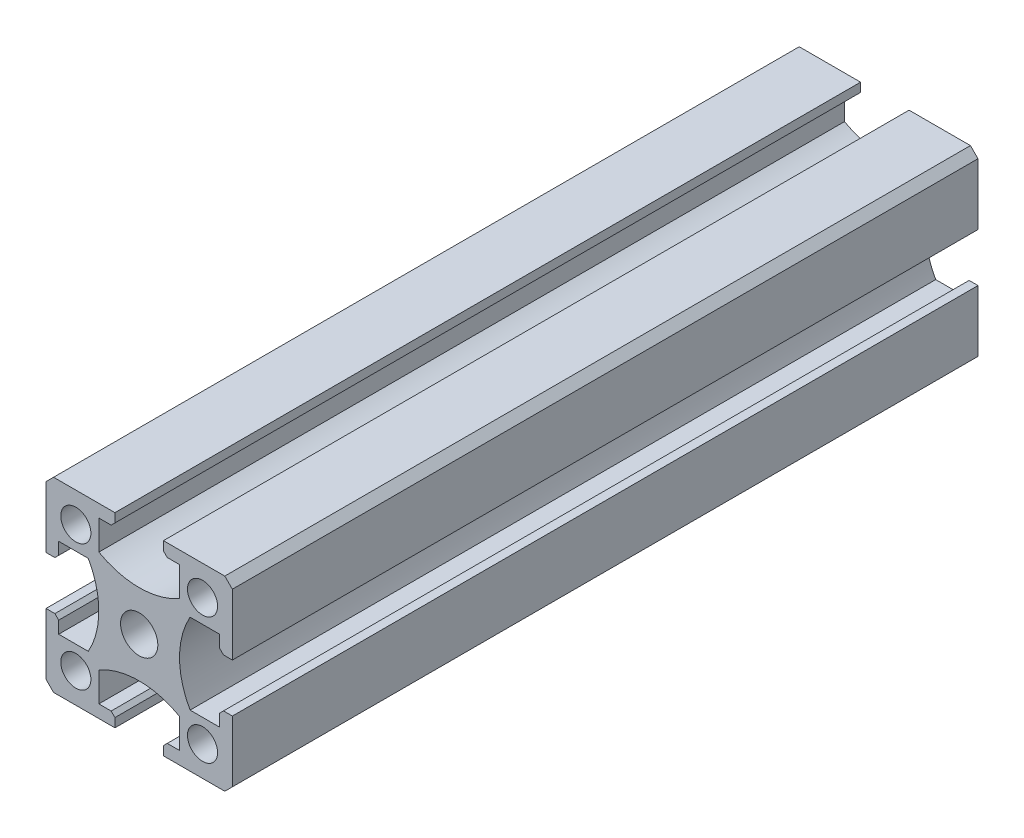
ISO-10303-21;
HEADER;
FILE_DESCRIPTION(('STEP AP214'),'2;1');
FILE_NAME('part.step','',(''),(''),'','','');
FILE_SCHEMA(('AUTOMOTIVE_DESIGN { 1 0 10303 214 1 1 1 1 }'));
ENDSEC;
DATA;
#1=APPLICATION_CONTEXT('core data for automotive mechanical design processes');
#2=APPLICATION_PROTOCOL_DEFINITION('international standard','automotive_design',2000,#1);
#3=PRODUCT_CONTEXT('',#1,'mechanical');
#4=PRODUCT('Part','Part','',(#3));
#5=PRODUCT_RELATED_PRODUCT_CATEGORY('part','',(#4));
#6=PRODUCT_DEFINITION_FORMATION('','',#4);
#7=PRODUCT_DEFINITION_CONTEXT('part definition',#1,'design');
#8=PRODUCT_DEFINITION('design','',#6,#7);
#9=PRODUCT_DEFINITION_SHAPE('','',#8);
#10=(LENGTH_UNIT() NAMED_UNIT(*) SI_UNIT(.MILLI.,.METRE.));
#11=(NAMED_UNIT(*) PLANE_ANGLE_UNIT() SI_UNIT($,.RADIAN.));
#12=(NAMED_UNIT(*) SI_UNIT($,.STERADIAN.) SOLID_ANGLE_UNIT());
#13=UNCERTAINTY_MEASURE_WITH_UNIT(LENGTH_MEASURE(1.E-05),#10,'distance_accuracy_value','');
#14=(GEOMETRIC_REPRESENTATION_CONTEXT(3) GLOBAL_UNCERTAINTY_ASSIGNED_CONTEXT((#13)) GLOBAL_UNIT_ASSIGNED_CONTEXT((#10,
#11,#12)) REPRESENTATION_CONTEXT('',''));
#15=CARTESIAN_POINT('',(0.,0.,0.));
#16=DIRECTION('',(0.,0.,1.));
#17=DIRECTION('',(1.,0.,0.));
#18=AXIS2_PLACEMENT_3D('',#15,#16,#17);
#19=CARTESIAN_POINT('',(-5.4102,0.,100.));
#20=DIRECTION('',(1.,0.,0.));
#21=DIRECTION('',(0.,1.,0.));
#22=AXIS2_PLACEMENT_3D('',#19,#20,#21);
#23=PLANE('',#22);
#24=DIRECTION('',(0.,-1.,0.));
#25=VECTOR('',#24,1.);
#26=CARTESIAN_POINT('',(-5.4102,0.,0.));
#27=LINE('',#26,#25);
#28=CARTESIAN_POINT('',(-5.4102,-6.83290318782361,0.));
#29=VERTEX_POINT('',#28);
#30=CARTESIAN_POINT('',(-5.41019999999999,-10.795,0.));
#31=VERTEX_POINT('',#30);
#32=EDGE_CURVE('E386',#29,#31,#27,.T.);
#33=ORIENTED_EDGE('',*,*,#32,.F.);
#34=DIRECTION('',(0.,0.,-1.));
#35=VECTOR('',#34,1.);
#36=CARTESIAN_POINT('',(-5.4102,-6.83290318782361,100.));
#37=LINE('',#36,#35);
#38=CARTESIAN_POINT('',(-5.4102,-6.83290318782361,100.));
#39=VERTEX_POINT('',#38);
#40=EDGE_CURVE('E11',#39,#29,#37,.T.);
#41=ORIENTED_EDGE('',*,*,#40,.F.);
#42=DIRECTION('',(0.,-1.,0.));
#43=VECTOR('',#42,1.);
#44=CARTESIAN_POINT('',(-5.4102,0.,100.));
#45=LINE('',#44,#43);
#46=CARTESIAN_POINT('',(-5.41019999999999,-10.795,100.));
#47=VERTEX_POINT('',#46);
#48=EDGE_CURVE('E645',#39,#47,#45,.T.);
#49=ORIENTED_EDGE('',*,*,#48,.T.);
#50=DIRECTION('',(0.,0.,-1.));
#51=VECTOR('',#50,1.);
#52=CARTESIAN_POINT('',(-5.41019999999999,-10.795,100.));
#53=LINE('',#52,#51);
#54=EDGE_CURVE('E53',#47,#31,#53,.T.);
#55=ORIENTED_EDGE('',*,*,#54,.T.);
#56=EDGE_LOOP('',(#33,#41,#49,#55));
#57=FACE_BOUND('',#56,.T.);
#58=ADVANCED_FACE('F36',(#57),#23,.T.);
#59=CARTESIAN_POINT('',(0.,-16.4084,100.));
#60=DIRECTION('',(0.,0.,-1.));
#61=DIRECTION('',(-1.,0.,0.));
#62=AXIS2_PLACEMENT_3D('',#59,#60,#61);
#63=CYLINDRICAL_SURFACE('',#62,10.9982);
#64=CARTESIAN_POINT('',(0.,-16.4084,0.));
#65=DIRECTION('',(0.,0.,1.));
#66=DIRECTION('',(1.,0.,0.));
#67=AXIS2_PLACEMENT_3D('',#64,#65,#66);
#68=CIRCLE('',#67,10.9982);
#69=CARTESIAN_POINT('',(5.4102,-6.83290318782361,0.));
#70=VERTEX_POINT('',#69);
#71=EDGE_CURVE('E388',#29,#70,#68,.F.);
#72=ORIENTED_EDGE('',*,*,#71,.T.);
#73=DIRECTION('',(0.,0.,-1.));
#74=VECTOR('',#73,1.);
#75=CARTESIAN_POINT('',(5.4102,-6.83290318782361,100.));
#76=LINE('',#75,#74);
#77=CARTESIAN_POINT('',(5.4102,-6.83290318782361,100.));
#78=VERTEX_POINT('',#77);
#79=EDGE_CURVE('E45',#78,#70,#76,.T.);
#80=ORIENTED_EDGE('',*,*,#79,.F.);
#81=CARTESIAN_POINT('',(0.,-16.4084,100.));
#82=DIRECTION('',(0.,0.,1.));
#83=DIRECTION('',(1.,0.,0.));
#84=AXIS2_PLACEMENT_3D('',#81,#82,#83);
#85=CIRCLE('',#84,10.9982);
#86=EDGE_CURVE('E641',#39,#78,#85,.F.);
#87=ORIENTED_EDGE('',*,*,#86,.F.);
#88=ORIENTED_EDGE('',*,*,#40,.T.);
#89=EDGE_LOOP('',(#72,#80,#87,#88));
#90=FACE_BOUND('',#89,.T.);
#91=ADVANCED_FACE('F629',(#90),#63,.F.);
#92=CARTESIAN_POINT('',(5.4102,0.,100.));
#93=DIRECTION('',(-1.,0.,0.));
#94=DIRECTION('',(0.,-1.,0.));
#95=AXIS2_PLACEMENT_3D('',#92,#93,#94);
#96=PLANE('',#95);
#97=DIRECTION('',(0.,1.,0.));
#98=VECTOR('',#97,1.);
#99=CARTESIAN_POINT('',(5.4102,0.,0.));
#100=LINE('',#99,#98);
#101=CARTESIAN_POINT('',(5.4102,-10.795,0.));
#102=VERTEX_POINT('',#101);
#103=EDGE_CURVE('E391',#102,#70,#100,.T.);
#104=ORIENTED_EDGE('',*,*,#103,.F.);
#105=DIRECTION('',(0.,0.,-1.));
#106=VECTOR('',#105,1.);
#107=CARTESIAN_POINT('',(5.4102,-10.795,100.));
#108=LINE('',#107,#106);
#109=CARTESIAN_POINT('',(5.4102,-10.795,100.));
#110=VERTEX_POINT('',#109);
#111=EDGE_CURVE('E619',#110,#102,#108,.T.);
#112=ORIENTED_EDGE('',*,*,#111,.F.);
#113=DIRECTION('',(0.,1.,0.));
#114=VECTOR('',#113,1.);
#115=CARTESIAN_POINT('',(5.4102,0.,100.));
#116=LINE('',#115,#114);
#117=EDGE_CURVE('E626',#110,#78,#116,.T.);
#118=ORIENTED_EDGE('',*,*,#117,.T.);
#119=ORIENTED_EDGE('',*,*,#79,.T.);
#120=EDGE_LOOP('',(#104,#112,#118,#119));
#121=FACE_BOUND('',#120,.T.);
#122=ADVANCED_FACE('F624',(#121),#96,.T.);
#123=CARTESIAN_POINT('',(0.,-10.795,100.));
#124=DIRECTION('',(0.,1.,0.));
#125=DIRECTION('',(0.,0.,1.));
#126=AXIS2_PLACEMENT_3D('',#123,#124,#125);
#127=PLANE('',#126);
#128=DIRECTION('',(1.,0.,0.));
#129=VECTOR('',#128,1.);
#130=CARTESIAN_POINT('',(0.,-10.795,0.));
#131=LINE('',#130,#129);
#132=CARTESIAN_POINT('',(3.7592,-10.795,0.));
#133=VERTEX_POINT('',#132);
#134=EDGE_CURVE('E394',#133,#102,#131,.T.);
#135=ORIENTED_EDGE('',*,*,#134,.F.);
#136=DIRECTION('',(0.,0.,-1.));
#137=VECTOR('',#136,1.);
#138=CARTESIAN_POINT('',(3.7592,-10.795,100.));
#139=LINE('',#138,#137);
#140=CARTESIAN_POINT('',(3.7592,-10.795,100.));
#141=VERTEX_POINT('',#140);
#142=EDGE_CURVE('E617',#141,#133,#139,.T.);
#143=ORIENTED_EDGE('',*,*,#142,.F.);
#144=DIRECTION('',(1.,0.,0.));
#145=VECTOR('',#144,1.);
#146=CARTESIAN_POINT('',(0.,-10.795,100.));
#147=LINE('',#146,#145);
#148=EDGE_CURVE('E638',#141,#110,#147,.T.);
#149=ORIENTED_EDGE('',*,*,#148,.T.);
#150=ORIENTED_EDGE('',*,*,#111,.T.);
#151=EDGE_LOOP('',(#135,#143,#149,#150));
#152=FACE_BOUND('',#151,.T.);
#153=ADVANCED_FACE('F635',(#152),#127,.T.);
#154=CARTESIAN_POINT('',(7.2771,-7.2771,100.));
#155=DIRECTION('',(-0.707106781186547,0.707106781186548,0.));
#156=DIRECTION('',(-0.707106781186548,-0.707106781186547,0.));
#157=AXIS2_PLACEMENT_3D('',#154,#155,#156);
#158=PLANE('',#157);
#159=DIRECTION('',(0.707106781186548,0.707106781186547,0.));
#160=VECTOR('',#159,1.);
#161=CARTESIAN_POINT('',(7.2771,-7.2771,0.));
#162=LINE('',#161,#160);
#163=CARTESIAN_POINT('',(3.2512,-11.303,0.));
#164=VERTEX_POINT('',#163);
#165=EDGE_CURVE('E397',#164,#133,#162,.T.);
#166=ORIENTED_EDGE('',*,*,#165,.F.);
#167=DIRECTION('',(0.,0.,-1.));
#168=VECTOR('',#167,1.);
#169=CARTESIAN_POINT('',(3.2512,-11.303,100.));
#170=LINE('',#169,#168);
#171=CARTESIAN_POINT('',(3.2512,-11.303,100.));
#172=VERTEX_POINT('',#171);
#173=EDGE_CURVE('E615',#172,#164,#170,.T.);
#174=ORIENTED_EDGE('',*,*,#173,.F.);
#175=DIRECTION('',(0.707106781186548,0.707106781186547,0.));
#176=VECTOR('',#175,1.);
#177=CARTESIAN_POINT('',(7.2771,-7.2771,100.));
#178=LINE('',#177,#176);
#179=EDGE_CURVE('E643',#172,#141,#178,.T.);
#180=ORIENTED_EDGE('',*,*,#179,.T.);
#181=ORIENTED_EDGE('',*,*,#142,.T.);
#182=EDGE_LOOP('',(#166,#174,#180,#181));
#183=FACE_BOUND('',#182,.T.);
#184=ADVANCED_FACE('F1274',(#183),#158,.T.);
#185=CARTESIAN_POINT('',(3.2512,0.,100.));
#186=DIRECTION('',(-1.,0.,0.));
#187=DIRECTION('',(0.,-1.,0.));
#188=AXIS2_PLACEMENT_3D('',#185,#186,#187);
#189=PLANE('',#188);
#190=DIRECTION('',(0.,1.,0.));
#191=VECTOR('',#190,1.);
#192=CARTESIAN_POINT('',(3.2512,0.,0.));
#193=LINE('',#192,#191);
#194=CARTESIAN_POINT('',(3.2512,-12.4968,0.));
#195=VERTEX_POINT('',#194);
#196=EDGE_CURVE('E400',#195,#164,#193,.T.);
#197=ORIENTED_EDGE('',*,*,#196,.F.);
#198=DIRECTION('',(0.,0.,-1.));
#199=VECTOR('',#198,1.);
#200=CARTESIAN_POINT('',(3.2512,-12.4968,100.));
#201=LINE('',#200,#199);
#202=CARTESIAN_POINT('',(3.2512,-12.4968,100.));
#203=VERTEX_POINT('',#202);
#204=EDGE_CURVE('E613',#203,#195,#201,.T.);
#205=ORIENTED_EDGE('',*,*,#204,.F.);
#206=DIRECTION('',(0.,1.,0.));
#207=VECTOR('',#206,1.);
#208=CARTESIAN_POINT('',(3.2512,0.,100.));
#209=LINE('',#208,#207);
#210=EDGE_CURVE('E650',#203,#172,#209,.T.);
#211=ORIENTED_EDGE('',*,*,#210,.T.);
#212=ORIENTED_EDGE('',*,*,#173,.T.);
#213=EDGE_LOOP('',(#197,#205,#211,#212));
#214=FACE_BOUND('',#213,.T.);
#215=ADVANCED_FACE('F1264',(#214),#189,.T.);
#216=CARTESIAN_POINT('',(0.,-12.4968,100.));
#217=DIRECTION('',(0.,-1.,0.));
#218=DIRECTION('',(0.,0.,-1.));
#219=AXIS2_PLACEMENT_3D('',#216,#217,#218);
#220=PLANE('',#219);
#221=DIRECTION('',(-1.,0.,0.));
#222=VECTOR('',#221,1.);
#223=CARTESIAN_POINT('',(0.,-12.4968,0.));
#224=LINE('',#223,#222);
#225=CARTESIAN_POINT('',(11.4808,-12.4968,0.));
#226=VERTEX_POINT('',#225);
#227=EDGE_CURVE('E403',#226,#195,#224,.T.);
#228=ORIENTED_EDGE('',*,*,#227,.F.);
#229=DIRECTION('',(0.,0.,-1.));
#230=VECTOR('',#229,1.);
#231=CARTESIAN_POINT('',(11.4808,-12.4968,100.));
#232=LINE('',#231,#230);
#233=CARTESIAN_POINT('',(11.4808,-12.4968,100.));
#234=VERTEX_POINT('',#233);
#235=EDGE_CURVE('E611',#234,#226,#232,.T.);
#236=ORIENTED_EDGE('',*,*,#235,.F.);
#237=DIRECTION('',(-1.,0.,0.));
#238=VECTOR('',#237,1.);
#239=CARTESIAN_POINT('',(0.,-12.4968,100.));
#240=LINE('',#239,#238);
#241=EDGE_CURVE('E653',#234,#203,#240,.T.);
#242=ORIENTED_EDGE('',*,*,#241,.T.);
#243=ORIENTED_EDGE('',*,*,#204,.T.);
#244=EDGE_LOOP('',(#228,#236,#242,#243));
#245=FACE_BOUND('',#244,.T.);
#246=ADVANCED_FACE('F1254',(#245),#220,.T.);
#247=CARTESIAN_POINT('',(11.9888,-11.9888,100.));
#248=DIRECTION('',(0.707106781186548,-0.707106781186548,0.));
#249=DIRECTION('',(0.707106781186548,0.707106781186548,0.));
#250=AXIS2_PLACEMENT_3D('',#247,#248,#249);
#251=PLANE('',#250);
#252=DIRECTION('',(-0.707106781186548,-0.707106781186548,0.));
#253=VECTOR('',#252,1.);
#254=CARTESIAN_POINT('',(11.9888,-11.9888,0.));
#255=LINE('',#254,#253);
#256=CARTESIAN_POINT('',(12.4968,-11.4808,0.));
#257=VERTEX_POINT('',#256);
#258=EDGE_CURVE('E406',#257,#226,#255,.T.);
#259=ORIENTED_EDGE('',*,*,#258,.F.);
#260=DIRECTION('',(0.,0.,-1.));
#261=VECTOR('',#260,1.);
#262=CARTESIAN_POINT('',(12.4968,-11.4808,100.));
#263=LINE('',#262,#261);
#264=CARTESIAN_POINT('',(12.4968,-11.4808,100.));
#265=VERTEX_POINT('',#264);
#266=EDGE_CURVE('E609',#265,#257,#263,.T.);
#267=ORIENTED_EDGE('',*,*,#266,.F.);
#268=DIRECTION('',(-0.707106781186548,-0.707106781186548,0.));
#269=VECTOR('',#268,1.);
#270=CARTESIAN_POINT('',(11.9888,-11.9888,100.));
#271=LINE('',#270,#269);
#272=EDGE_CURVE('E656',#265,#234,#271,.T.);
#273=ORIENTED_EDGE('',*,*,#272,.T.);
#274=ORIENTED_EDGE('',*,*,#235,.T.);
#275=EDGE_LOOP('',(#259,#267,#273,#274));
#276=FACE_BOUND('',#275,.T.);
#277=ADVANCED_FACE('F1244',(#276),#251,.T.);
#278=CARTESIAN_POINT('',(12.4968,0.,100.));
#279=DIRECTION('',(1.,0.,0.));
#280=DIRECTION('',(0.,0.,-1.));
#281=AXIS2_PLACEMENT_3D('',#278,#279,#280);
#282=PLANE('',#281);
#283=DIRECTION('',(0.,-1.,0.));
#284=VECTOR('',#283,1.);
#285=CARTESIAN_POINT('',(12.4968,0.,0.));
#286=LINE('',#285,#284);
#287=CARTESIAN_POINT('',(12.4968,-3.2512,0.));
#288=VERTEX_POINT('',#287);
#289=EDGE_CURVE('E409',#288,#257,#286,.T.);
#290=ORIENTED_EDGE('',*,*,#289,.F.);
#291=DIRECTION('',(0.,0.,-1.));
#292=VECTOR('',#291,1.);
#293=CARTESIAN_POINT('',(12.4968,-3.2512,100.));
#294=LINE('',#293,#292);
#295=CARTESIAN_POINT('',(12.4968,-3.2512,100.));
#296=VERTEX_POINT('',#295);
#297=EDGE_CURVE('E607',#296,#288,#294,.T.);
#298=ORIENTED_EDGE('',*,*,#297,.F.);
#299=DIRECTION('',(0.,-1.,0.));
#300=VECTOR('',#299,1.);
#301=CARTESIAN_POINT('',(12.4968,0.,100.));
#302=LINE('',#301,#300);
#303=EDGE_CURVE('E659',#296,#265,#302,.T.);
#304=ORIENTED_EDGE('',*,*,#303,.T.);
#305=ORIENTED_EDGE('',*,*,#266,.T.);
#306=EDGE_LOOP('',(#290,#298,#304,#305));
#307=FACE_BOUND('',#306,.T.);
#308=ADVANCED_FACE('F1234',(#307),#282,.T.);
#309=CARTESIAN_POINT('',(0.,-3.2512,100.));
#310=DIRECTION('',(0.,1.,0.));
#311=DIRECTION('',(-1.,0.,0.));
#312=AXIS2_PLACEMENT_3D('',#309,#310,#311);
#313=PLANE('',#312);
#314=DIRECTION('',(1.,0.,0.));
#315=VECTOR('',#314,1.);
#316=CARTESIAN_POINT('',(0.,-3.2512,0.));
#317=LINE('',#316,#315);
#318=CARTESIAN_POINT('',(11.303,-3.2512,0.));
#319=VERTEX_POINT('',#318);
#320=EDGE_CURVE('E412',#319,#288,#317,.T.);
#321=ORIENTED_EDGE('',*,*,#320,.F.);
#322=DIRECTION('',(0.,0.,-1.));
#323=VECTOR('',#322,1.);
#324=CARTESIAN_POINT('',(11.303,-3.2512,100.));
#325=LINE('',#324,#323);
#326=CARTESIAN_POINT('',(11.303,-3.2512,100.));
#327=VERTEX_POINT('',#326);
#328=EDGE_CURVE('E605',#327,#319,#325,.T.);
#329=ORIENTED_EDGE('',*,*,#328,.F.);
#330=DIRECTION('',(1.,0.,0.));
#331=VECTOR('',#330,1.);
#332=CARTESIAN_POINT('',(0.,-3.2512,100.));
#333=LINE('',#332,#331);
#334=EDGE_CURVE('E662',#327,#296,#333,.T.);
#335=ORIENTED_EDGE('',*,*,#334,.T.);
#336=ORIENTED_EDGE('',*,*,#297,.T.);
#337=EDGE_LOOP('',(#321,#329,#335,#336));
#338=FACE_BOUND('',#337,.T.);
#339=ADVANCED_FACE('F1224',(#338),#313,.T.);
#340=CARTESIAN_POINT('',(7.2771,-7.2771,100.));
#341=DIRECTION('',(-0.707106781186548,0.707106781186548,0.));
#342=DIRECTION('',(-0.707106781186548,-0.707106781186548,0.));
#343=AXIS2_PLACEMENT_3D('',#340,#341,#342);
#344=PLANE('',#343);
#345=DIRECTION('',(0.707106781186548,0.707106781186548,0.));
#346=VECTOR('',#345,1.);
#347=CARTESIAN_POINT('',(7.2771,-7.2771,0.));
#348=LINE('',#347,#346);
#349=CARTESIAN_POINT('',(10.795,-3.7592,0.));
#350=VERTEX_POINT('',#349);
#351=EDGE_CURVE('E415',#350,#319,#348,.T.);
#352=ORIENTED_EDGE('',*,*,#351,.F.);
#353=DIRECTION('',(0.,0.,-1.));
#354=VECTOR('',#353,1.);
#355=CARTESIAN_POINT('',(10.795,-3.7592,100.));
#356=LINE('',#355,#354);
#357=CARTESIAN_POINT('',(10.795,-3.7592,100.));
#358=VERTEX_POINT('',#357);
#359=EDGE_CURVE('E603',#358,#350,#356,.T.);
#360=ORIENTED_EDGE('',*,*,#359,.F.);
#361=DIRECTION('',(0.707106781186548,0.707106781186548,0.));
#362=VECTOR('',#361,1.);
#363=CARTESIAN_POINT('',(7.2771,-7.2771,100.));
#364=LINE('',#363,#362);
#365=EDGE_CURVE('E665',#358,#327,#364,.T.);
#366=ORIENTED_EDGE('',*,*,#365,.T.);
#367=ORIENTED_EDGE('',*,*,#328,.T.);
#368=EDGE_LOOP('',(#352,#360,#366,#367));
#369=FACE_BOUND('',#368,.T.);
#370=ADVANCED_FACE('F1214',(#369),#344,.T.);
#371=CARTESIAN_POINT('',(10.795,0.,100.));
#372=DIRECTION('',(-1.,0.,0.));
#373=DIRECTION('',(0.,0.,1.));
#374=AXIS2_PLACEMENT_3D('',#371,#372,#373);
#375=PLANE('',#374);
#376=DIRECTION('',(0.,1.,0.));
#377=VECTOR('',#376,1.);
#378=CARTESIAN_POINT('',(10.795,0.,0.));
#379=LINE('',#378,#377);
#380=CARTESIAN_POINT('',(10.795,-5.3975,0.));
#381=VERTEX_POINT('',#380);
#382=EDGE_CURVE('E418',#381,#350,#379,.T.);
#383=ORIENTED_EDGE('',*,*,#382,.F.);
#384=DIRECTION('',(0.,0.,-1.));
#385=VECTOR('',#384,1.);
#386=CARTESIAN_POINT('',(10.795,-5.3975,100.));
#387=LINE('',#386,#385);
#388=CARTESIAN_POINT('',(10.795,-5.3975,100.));
#389=VERTEX_POINT('',#388);
#390=EDGE_CURVE('E601',#389,#381,#387,.T.);
#391=ORIENTED_EDGE('',*,*,#390,.F.);
#392=DIRECTION('',(0.,1.,0.));
#393=VECTOR('',#392,1.);
#394=CARTESIAN_POINT('',(10.795,0.,100.));
#395=LINE('',#394,#393);
#396=EDGE_CURVE('E668',#389,#358,#395,.T.);
#397=ORIENTED_EDGE('',*,*,#396,.T.);
#398=ORIENTED_EDGE('',*,*,#359,.T.);
#399=EDGE_LOOP('',(#383,#391,#397,#398));
#400=FACE_BOUND('',#399,.T.);
#401=ADVANCED_FACE('F1204',(#400),#375,.T.);
#402=CARTESIAN_POINT('',(0.,-5.39749999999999,100.));
#403=DIRECTION('',(0.,1.,0.));
#404=DIRECTION('',(-1.,0.,0.));
#405=AXIS2_PLACEMENT_3D('',#402,#403,#404);
#406=PLANE('',#405);
#407=DIRECTION('',(1.,0.,0.));
#408=VECTOR('',#407,1.);
#409=CARTESIAN_POINT('',(0.,-5.39749999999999,0.));
#410=LINE('',#409,#408);
#411=CARTESIAN_POINT('',(6.82573873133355,-5.3975,0.));
#412=VERTEX_POINT('',#411);
#413=EDGE_CURVE('E421',#412,#381,#410,.T.);
#414=ORIENTED_EDGE('',*,*,#413,.F.);
#415=DIRECTION('',(0.,0.,-1.));
#416=VECTOR('',#415,1.);
#417=CARTESIAN_POINT('',(6.82573873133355,-5.3975,100.));
#418=LINE('',#417,#416);
#419=CARTESIAN_POINT('',(6.82573873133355,-5.3975,100.));
#420=VERTEX_POINT('',#419);
#421=EDGE_CURVE('E599',#420,#412,#418,.T.);
#422=ORIENTED_EDGE('',*,*,#421,.F.);
#423=DIRECTION('',(1.,0.,0.));
#424=VECTOR('',#423,1.);
#425=CARTESIAN_POINT('',(0.,-5.39749999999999,100.));
#426=LINE('',#425,#424);
#427=EDGE_CURVE('E671',#420,#389,#426,.T.);
#428=ORIENTED_EDGE('',*,*,#427,.T.);
#429=ORIENTED_EDGE('',*,*,#390,.T.);
#430=EDGE_LOOP('',(#414,#422,#428,#429));
#431=FACE_BOUND('',#430,.T.);
#432=ADVANCED_FACE('F1194',(#431),#406,.T.);
#433=CARTESIAN_POINT('',(16.4084,0.,100.));
#434=DIRECTION('',(0.,0.,-1.));
#435=DIRECTION('',(-1.,0.,0.));
#436=AXIS2_PLACEMENT_3D('',#433,#434,#435);
#437=CYLINDRICAL_SURFACE('',#436,10.9982);
#438=CARTESIAN_POINT('',(16.4084,0.,0.));
#439=DIRECTION('',(0.,0.,1.));
#440=DIRECTION('',(1.,0.,0.));
#441=AXIS2_PLACEMENT_3D('',#438,#439,#440);
#442=CIRCLE('',#441,10.9982);
#443=CARTESIAN_POINT('',(6.82573873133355,5.3975,0.));
#444=VERTEX_POINT('',#443);
#445=EDGE_CURVE('E424',#444,#412,#442,.T.);
#446=ORIENTED_EDGE('',*,*,#445,.F.);
#447=DIRECTION('',(0.,0.,-1.));
#448=VECTOR('',#447,1.);
#449=CARTESIAN_POINT('',(6.82573873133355,5.3975,100.));
#450=LINE('',#449,#448);
#451=CARTESIAN_POINT('',(6.82573873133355,5.3975,100.));
#452=VERTEX_POINT('',#451);
#453=EDGE_CURVE('E597',#452,#444,#450,.T.);
#454=ORIENTED_EDGE('',*,*,#453,.F.);
#455=CARTESIAN_POINT('',(16.4084,0.,100.));
#456=DIRECTION('',(0.,0.,1.));
#457=DIRECTION('',(1.,0.,0.));
#458=AXIS2_PLACEMENT_3D('',#455,#456,#457);
#459=CIRCLE('',#458,10.9982);
#460=EDGE_CURVE('E674',#452,#420,#459,.T.);
#461=ORIENTED_EDGE('',*,*,#460,.T.);
#462=ORIENTED_EDGE('',*,*,#421,.T.);
#463=EDGE_LOOP('',(#446,#454,#461,#462));
#464=FACE_BOUND('',#463,.T.);
#465=ADVANCED_FACE('F1184',(#464),#437,.F.);
#466=CARTESIAN_POINT('',(0.,5.3975,100.));
#467=DIRECTION('',(0.,-1.,0.));
#468=DIRECTION('',(1.,0.,0.));
#469=AXIS2_PLACEMENT_3D('',#466,#467,#468);
#470=PLANE('',#469);
#471=DIRECTION('',(-1.,0.,0.));
#472=VECTOR('',#471,1.);
#473=CARTESIAN_POINT('',(0.,5.3975,0.));
#474=LINE('',#473,#472);
#475=CARTESIAN_POINT('',(10.795,5.3975,0.));
#476=VERTEX_POINT('',#475);
#477=EDGE_CURVE('E427',#476,#444,#474,.T.);
#478=ORIENTED_EDGE('',*,*,#477,.F.);
#479=DIRECTION('',(0.,0.,-1.));
#480=VECTOR('',#479,1.);
#481=CARTESIAN_POINT('',(10.795,5.3975,100.));
#482=LINE('',#481,#480);
#483=CARTESIAN_POINT('',(10.795,5.3975,100.));
#484=VERTEX_POINT('',#483);
#485=EDGE_CURVE('E595',#484,#476,#482,.T.);
#486=ORIENTED_EDGE('',*,*,#485,.F.);
#487=DIRECTION('',(-1.,0.,0.));
#488=VECTOR('',#487,1.);
#489=CARTESIAN_POINT('',(0.,5.3975,100.));
#490=LINE('',#489,#488);
#491=EDGE_CURVE('E677',#484,#452,#490,.T.);
#492=ORIENTED_EDGE('',*,*,#491,.T.);
#493=ORIENTED_EDGE('',*,*,#453,.T.);
#494=EDGE_LOOP('',(#478,#486,#492,#493));
#495=FACE_BOUND('',#494,.T.);
#496=ADVANCED_FACE('F1174',(#495),#470,.T.);
#497=CARTESIAN_POINT('',(10.795,0.,100.));
#498=DIRECTION('',(-1.,0.,0.));
#499=DIRECTION('',(0.,0.,1.));
#500=AXIS2_PLACEMENT_3D('',#497,#498,#499);
#501=PLANE('',#500);
#502=DIRECTION('',(0.,1.,0.));
#503=VECTOR('',#502,1.);
#504=CARTESIAN_POINT('',(10.795,0.,0.));
#505=LINE('',#504,#503);
#506=CARTESIAN_POINT('',(10.795,3.7592,0.));
#507=VERTEX_POINT('',#506);
#508=EDGE_CURVE('E430',#507,#476,#505,.T.);
#509=ORIENTED_EDGE('',*,*,#508,.F.);
#510=DIRECTION('',(0.,0.,-1.));
#511=VECTOR('',#510,1.);
#512=CARTESIAN_POINT('',(10.795,3.7592,100.));
#513=LINE('',#512,#511);
#514=CARTESIAN_POINT('',(10.795,3.7592,100.));
#515=VERTEX_POINT('',#514);
#516=EDGE_CURVE('E593',#515,#507,#513,.T.);
#517=ORIENTED_EDGE('',*,*,#516,.F.);
#518=DIRECTION('',(0.,1.,0.));
#519=VECTOR('',#518,1.);
#520=CARTESIAN_POINT('',(10.795,0.,100.));
#521=LINE('',#520,#519);
#522=EDGE_CURVE('E680',#515,#484,#521,.T.);
#523=ORIENTED_EDGE('',*,*,#522,.T.);
#524=ORIENTED_EDGE('',*,*,#485,.T.);
#525=EDGE_LOOP('',(#509,#517,#523,#524));
#526=FACE_BOUND('',#525,.T.);
#527=ADVANCED_FACE('F1164',(#526),#501,.T.);
#528=CARTESIAN_POINT('',(7.2771,7.2771,100.));
#529=DIRECTION('',(-0.707106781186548,-0.707106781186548,0.));
#530=DIRECTION('',(0.707106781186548,-0.707106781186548,0.));
#531=AXIS2_PLACEMENT_3D('',#528,#529,#530);
#532=PLANE('',#531);
#533=DIRECTION('',(-0.707106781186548,0.707106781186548,0.));
#534=VECTOR('',#533,1.);
#535=CARTESIAN_POINT('',(7.2771,7.2771,0.));
#536=LINE('',#535,#534);
#537=CARTESIAN_POINT('',(11.303,3.2512,0.));
#538=VERTEX_POINT('',#537);
#539=EDGE_CURVE('E433',#538,#507,#536,.T.);
#540=ORIENTED_EDGE('',*,*,#539,.F.);
#541=DIRECTION('',(0.,0.,-1.));
#542=VECTOR('',#541,1.);
#543=CARTESIAN_POINT('',(11.303,3.2512,100.));
#544=LINE('',#543,#542);
#545=CARTESIAN_POINT('',(11.303,3.2512,100.));
#546=VERTEX_POINT('',#545);
#547=EDGE_CURVE('E591',#546,#538,#544,.T.);
#548=ORIENTED_EDGE('',*,*,#547,.F.);
#549=DIRECTION('',(-0.707106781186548,0.707106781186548,0.));
#550=VECTOR('',#549,1.);
#551=CARTESIAN_POINT('',(7.2771,7.2771,100.));
#552=LINE('',#551,#550);
#553=EDGE_CURVE('E683',#546,#515,#552,.T.);
#554=ORIENTED_EDGE('',*,*,#553,.T.);
#555=ORIENTED_EDGE('',*,*,#516,.T.);
#556=EDGE_LOOP('',(#540,#548,#554,#555));
#557=FACE_BOUND('',#556,.T.);
#558=ADVANCED_FACE('F1154',(#557),#532,.T.);
#559=CARTESIAN_POINT('',(0.,3.2512,100.));
#560=DIRECTION('',(0.,-1.,0.));
#561=DIRECTION('',(1.,0.,0.));
#562=AXIS2_PLACEMENT_3D('',#559,#560,#561);
#563=PLANE('',#562);
#564=DIRECTION('',(-1.,0.,0.));
#565=VECTOR('',#564,1.);
#566=CARTESIAN_POINT('',(0.,3.2512,0.));
#567=LINE('',#566,#565);
#568=CARTESIAN_POINT('',(12.4968,3.2512,0.));
#569=VERTEX_POINT('',#568);
#570=EDGE_CURVE('E436',#569,#538,#567,.T.);
#571=ORIENTED_EDGE('',*,*,#570,.F.);
#572=DIRECTION('',(0.,0.,-1.));
#573=VECTOR('',#572,1.);
#574=CARTESIAN_POINT('',(12.4968,3.2512,100.));
#575=LINE('',#574,#573);
#576=CARTESIAN_POINT('',(12.4968,3.2512,100.));
#577=VERTEX_POINT('',#576);
#578=EDGE_CURVE('E589',#577,#569,#575,.T.);
#579=ORIENTED_EDGE('',*,*,#578,.F.);
#580=DIRECTION('',(-1.,0.,0.));
#581=VECTOR('',#580,1.);
#582=CARTESIAN_POINT('',(0.,3.2512,100.));
#583=LINE('',#582,#581);
#584=EDGE_CURVE('E686',#577,#546,#583,.T.);
#585=ORIENTED_EDGE('',*,*,#584,.T.);
#586=ORIENTED_EDGE('',*,*,#547,.T.);
#587=EDGE_LOOP('',(#571,#579,#585,#586));
#588=FACE_BOUND('',#587,.T.);
#589=ADVANCED_FACE('F1144',(#588),#563,.T.);
#590=CARTESIAN_POINT('',(12.4968,0.,100.));
#591=DIRECTION('',(1.,0.,0.));
#592=DIRECTION('',(0.,0.,-1.));
#593=AXIS2_PLACEMENT_3D('',#590,#591,#592);
#594=PLANE('',#593);
#595=DIRECTION('',(0.,-1.,0.));
#596=VECTOR('',#595,1.);
#597=CARTESIAN_POINT('',(12.4968,0.,0.));
#598=LINE('',#597,#596);
#599=CARTESIAN_POINT('',(12.4968,11.4808,0.));
#600=VERTEX_POINT('',#599);
#601=EDGE_CURVE('E439',#600,#569,#598,.T.);
#602=ORIENTED_EDGE('',*,*,#601,.F.);
#603=DIRECTION('',(0.,0.,-1.));
#604=VECTOR('',#603,1.);
#605=CARTESIAN_POINT('',(12.4968,11.4808,100.));
#606=LINE('',#605,#604);
#607=CARTESIAN_POINT('',(12.4968,11.4808,100.));
#608=VERTEX_POINT('',#607);
#609=EDGE_CURVE('E587',#608,#600,#606,.T.);
#610=ORIENTED_EDGE('',*,*,#609,.F.);
#611=DIRECTION('',(0.,-1.,0.));
#612=VECTOR('',#611,1.);
#613=CARTESIAN_POINT('',(12.4968,0.,100.));
#614=LINE('',#613,#612);
#615=EDGE_CURVE('E689',#608,#577,#614,.T.);
#616=ORIENTED_EDGE('',*,*,#615,.T.);
#617=ORIENTED_EDGE('',*,*,#578,.T.);
#618=EDGE_LOOP('',(#602,#610,#616,#617));
#619=FACE_BOUND('',#618,.T.);
#620=ADVANCED_FACE('F1134',(#619),#594,.T.);
#621=CARTESIAN_POINT('',(11.9888,11.9888,100.));
#622=DIRECTION('',(0.707106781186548,0.707106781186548,0.));
#623=DIRECTION('',(-0.707106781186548,0.707106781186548,0.));
#624=AXIS2_PLACEMENT_3D('',#621,#622,#623);
#625=PLANE('',#624);
#626=DIRECTION('',(0.707106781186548,-0.707106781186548,0.));
#627=VECTOR('',#626,1.);
#628=CARTESIAN_POINT('',(11.9888,11.9888,0.));
#629=LINE('',#628,#627);
#630=CARTESIAN_POINT('',(11.4808,12.4968,0.));
#631=VERTEX_POINT('',#630);
#632=EDGE_CURVE('E442',#631,#600,#629,.T.);
#633=ORIENTED_EDGE('',*,*,#632,.F.);
#634=DIRECTION('',(0.,0.,-1.));
#635=VECTOR('',#634,1.);
#636=CARTESIAN_POINT('',(11.4808,12.4968,100.));
#637=LINE('',#636,#635);
#638=CARTESIAN_POINT('',(11.4808,12.4968,100.));
#639=VERTEX_POINT('',#638);
#640=EDGE_CURVE('E585',#639,#631,#637,.T.);
#641=ORIENTED_EDGE('',*,*,#640,.F.);
#642=DIRECTION('',(0.707106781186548,-0.707106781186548,0.));
#643=VECTOR('',#642,1.);
#644=CARTESIAN_POINT('',(11.9888,11.9888,100.));
#645=LINE('',#644,#643);
#646=EDGE_CURVE('E692',#639,#608,#645,.T.);
#647=ORIENTED_EDGE('',*,*,#646,.T.);
#648=ORIENTED_EDGE('',*,*,#609,.T.);
#649=EDGE_LOOP('',(#633,#641,#647,#648));
#650=FACE_BOUND('',#649,.T.);
#651=ADVANCED_FACE('F1124',(#650),#625,.T.);
#652=CARTESIAN_POINT('',(0.,12.4968,100.));
#653=DIRECTION('',(0.,1.,0.));
#654=DIRECTION('',(0.,0.,1.));
#655=AXIS2_PLACEMENT_3D('',#652,#653,#654);
#656=PLANE('',#655);
#657=DIRECTION('',(1.,0.,0.));
#658=VECTOR('',#657,1.);
#659=CARTESIAN_POINT('',(0.,12.4968,0.));
#660=LINE('',#659,#658);
#661=CARTESIAN_POINT('',(3.2512,12.4968,0.));
#662=VERTEX_POINT('',#661);
#663=EDGE_CURVE('E445',#662,#631,#660,.T.);
#664=ORIENTED_EDGE('',*,*,#663,.F.);
#665=DIRECTION('',(0.,0.,-1.));
#666=VECTOR('',#665,1.);
#667=CARTESIAN_POINT('',(3.2512,12.4968,100.));
#668=LINE('',#667,#666);
#669=CARTESIAN_POINT('',(3.2512,12.4968,100.));
#670=VERTEX_POINT('',#669);
#671=EDGE_CURVE('E583',#670,#662,#668,.T.);
#672=ORIENTED_EDGE('',*,*,#671,.F.);
#673=DIRECTION('',(1.,0.,0.));
#674=VECTOR('',#673,1.);
#675=CARTESIAN_POINT('',(0.,12.4968,100.));
#676=LINE('',#675,#674);
#677=EDGE_CURVE('E695',#670,#639,#676,.T.);
#678=ORIENTED_EDGE('',*,*,#677,.T.);
#679=ORIENTED_EDGE('',*,*,#640,.T.);
#680=EDGE_LOOP('',(#664,#672,#678,#679));
#681=FACE_BOUND('',#680,.T.);
#682=ADVANCED_FACE('F1114',(#681),#656,.T.);
#683=CARTESIAN_POINT('',(3.2512,0.,100.));
#684=DIRECTION('',(-1.,0.,0.));
#685=DIRECTION('',(0.,-1.,0.));
#686=AXIS2_PLACEMENT_3D('',#683,#684,#685);
#687=PLANE('',#686);
#688=DIRECTION('',(0.,1.,0.));
#689=VECTOR('',#688,1.);
#690=CARTESIAN_POINT('',(3.2512,0.,0.));
#691=LINE('',#690,#689);
#692=CARTESIAN_POINT('',(3.2512,11.303,0.));
#693=VERTEX_POINT('',#692);
#694=EDGE_CURVE('E448',#693,#662,#691,.T.);
#695=ORIENTED_EDGE('',*,*,#694,.F.);
#696=DIRECTION('',(0.,0.,-1.));
#697=VECTOR('',#696,1.);
#698=CARTESIAN_POINT('',(3.2512,11.303,100.));
#699=LINE('',#698,#697);
#700=CARTESIAN_POINT('',(3.2512,11.303,100.));
#701=VERTEX_POINT('',#700);
#702=EDGE_CURVE('E581',#701,#693,#699,.T.);
#703=ORIENTED_EDGE('',*,*,#702,.F.);
#704=DIRECTION('',(0.,1.,0.));
#705=VECTOR('',#704,1.);
#706=CARTESIAN_POINT('',(3.2512,0.,100.));
#707=LINE('',#706,#705);
#708=EDGE_CURVE('E698',#701,#670,#707,.T.);
#709=ORIENTED_EDGE('',*,*,#708,.T.);
#710=ORIENTED_EDGE('',*,*,#671,.T.);
#711=EDGE_LOOP('',(#695,#703,#709,#710));
#712=FACE_BOUND('',#711,.T.);
#713=ADVANCED_FACE('F1104',(#712),#687,.T.);
#714=CARTESIAN_POINT('',(7.2771,7.2771,100.));
#715=DIRECTION('',(-0.707106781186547,-0.707106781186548,0.));
#716=DIRECTION('',(0.707106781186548,-0.707106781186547,0.));
#717=AXIS2_PLACEMENT_3D('',#714,#715,#716);
#718=PLANE('',#717);
#719=DIRECTION('',(-0.707106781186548,0.707106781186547,0.));
#720=VECTOR('',#719,1.);
#721=CARTESIAN_POINT('',(7.2771,7.2771,0.));
#722=LINE('',#721,#720);
#723=CARTESIAN_POINT('',(3.7592,10.795,0.));
#724=VERTEX_POINT('',#723);
#725=EDGE_CURVE('E451',#724,#693,#722,.T.);
#726=ORIENTED_EDGE('',*,*,#725,.F.);
#727=DIRECTION('',(0.,0.,-1.));
#728=VECTOR('',#727,1.);
#729=CARTESIAN_POINT('',(3.7592,10.795,100.));
#730=LINE('',#729,#728);
#731=CARTESIAN_POINT('',(3.7592,10.795,100.));
#732=VERTEX_POINT('',#731);
#733=EDGE_CURVE('E579',#732,#724,#730,.T.);
#734=ORIENTED_EDGE('',*,*,#733,.F.);
#735=DIRECTION('',(-0.707106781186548,0.707106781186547,0.));
#736=VECTOR('',#735,1.);
#737=CARTESIAN_POINT('',(7.2771,7.2771,100.));
#738=LINE('',#737,#736);
#739=EDGE_CURVE('E701',#732,#701,#738,.T.);
#740=ORIENTED_EDGE('',*,*,#739,.T.);
#741=ORIENTED_EDGE('',*,*,#702,.T.);
#742=EDGE_LOOP('',(#726,#734,#740,#741));
#743=FACE_BOUND('',#742,.T.);
#744=ADVANCED_FACE('F1094',(#743),#718,.T.);
#745=CARTESIAN_POINT('',(0.,10.795,100.));
#746=DIRECTION('',(0.,-1.,0.));
#747=DIRECTION('',(0.,0.,-1.));
#748=AXIS2_PLACEMENT_3D('',#745,#746,#747);
#749=PLANE('',#748);
#750=DIRECTION('',(-1.,0.,0.));
#751=VECTOR('',#750,1.);
#752=CARTESIAN_POINT('',(0.,10.795,0.));
#753=LINE('',#752,#751);
#754=CARTESIAN_POINT('',(5.4102,10.795,0.));
#755=VERTEX_POINT('',#754);
#756=EDGE_CURVE('E454',#755,#724,#753,.T.);
#757=ORIENTED_EDGE('',*,*,#756,.F.);
#758=DIRECTION('',(0.,0.,-1.));
#759=VECTOR('',#758,1.);
#760=CARTESIAN_POINT('',(5.4102,10.795,100.));
#761=LINE('',#760,#759);
#762=CARTESIAN_POINT('',(5.4102,10.795,100.));
#763=VERTEX_POINT('',#762);
#764=EDGE_CURVE('E577',#763,#755,#761,.T.);
#765=ORIENTED_EDGE('',*,*,#764,.F.);
#766=DIRECTION('',(-1.,0.,0.));
#767=VECTOR('',#766,1.);
#768=CARTESIAN_POINT('',(0.,10.795,100.));
#769=LINE('',#768,#767);
#770=EDGE_CURVE('E704',#763,#732,#769,.T.);
#771=ORIENTED_EDGE('',*,*,#770,.T.);
#772=ORIENTED_EDGE('',*,*,#733,.T.);
#773=EDGE_LOOP('',(#757,#765,#771,#772));
#774=FACE_BOUND('',#773,.T.);
#775=ADVANCED_FACE('F1084',(#774),#749,.T.);
#776=CARTESIAN_POINT('',(5.4102,0.,100.));
#777=DIRECTION('',(-1.,0.,0.));
#778=DIRECTION('',(0.,-1.,0.));
#779=AXIS2_PLACEMENT_3D('',#776,#777,#778);
#780=PLANE('',#779);
#781=DIRECTION('',(0.,1.,0.));
#782=VECTOR('',#781,1.);
#783=CARTESIAN_POINT('',(5.4102,0.,0.));
#784=LINE('',#783,#782);
#785=CARTESIAN_POINT('',(5.4102,6.83290318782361,0.));
#786=VERTEX_POINT('',#785);
#787=EDGE_CURVE('E457',#786,#755,#784,.T.);
#788=ORIENTED_EDGE('',*,*,#787,.F.);
#789=DIRECTION('',(0.,0.,-1.));
#790=VECTOR('',#789,1.);
#791=CARTESIAN_POINT('',(5.4102,6.83290318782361,100.));
#792=LINE('',#791,#790);
#793=CARTESIAN_POINT('',(5.4102,6.83290318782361,100.));
#794=VERTEX_POINT('',#793);
#795=EDGE_CURVE('E575',#794,#786,#792,.T.);
#796=ORIENTED_EDGE('',*,*,#795,.F.);
#797=DIRECTION('',(0.,1.,0.));
#798=VECTOR('',#797,1.);
#799=CARTESIAN_POINT('',(5.4102,0.,100.));
#800=LINE('',#799,#798);
#801=EDGE_CURVE('E707',#794,#763,#800,.T.);
#802=ORIENTED_EDGE('',*,*,#801,.T.);
#803=ORIENTED_EDGE('',*,*,#764,.T.);
#804=EDGE_LOOP('',(#788,#796,#802,#803));
#805=FACE_BOUND('',#804,.T.);
#806=ADVANCED_FACE('F1074',(#805),#780,.T.);
#807=CARTESIAN_POINT('',(0.,16.4084,100.));
#808=DIRECTION('',(0.,0.,-1.));
#809=DIRECTION('',(-1.,0.,0.));
#810=AXIS2_PLACEMENT_3D('',#807,#808,#809);
#811=CYLINDRICAL_SURFACE('',#810,10.9982);
#812=CARTESIAN_POINT('',(0.,16.4084,0.));
#813=DIRECTION('',(0.,0.,1.));
#814=DIRECTION('',(1.,0.,0.));
#815=AXIS2_PLACEMENT_3D('',#812,#813,#814);
#816=CIRCLE('',#815,10.9982);
#817=CARTESIAN_POINT('',(-5.4102,6.83290318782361,0.));
#818=VERTEX_POINT('',#817);
#819=EDGE_CURVE('E460',#786,#818,#816,.F.);
#820=ORIENTED_EDGE('',*,*,#819,.T.);
#821=DIRECTION('',(0.,0.,-1.));
#822=VECTOR('',#821,1.);
#823=CARTESIAN_POINT('',(-5.4102,6.83290318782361,100.));
#824=LINE('',#823,#822);
#825=CARTESIAN_POINT('',(-5.4102,6.83290318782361,100.));
#826=VERTEX_POINT('',#825);
#827=EDGE_CURVE('E573',#826,#818,#824,.T.);
#828=ORIENTED_EDGE('',*,*,#827,.F.);
#829=CARTESIAN_POINT('',(0.,16.4084,100.));
#830=DIRECTION('',(0.,0.,1.));
#831=DIRECTION('',(1.,0.,0.));
#832=AXIS2_PLACEMENT_3D('',#829,#830,#831);
#833=CIRCLE('',#832,10.9982);
#834=EDGE_CURVE('E710',#794,#826,#833,.F.);
#835=ORIENTED_EDGE('',*,*,#834,.F.);
#836=ORIENTED_EDGE('',*,*,#795,.T.);
#837=EDGE_LOOP('',(#820,#828,#835,#836));
#838=FACE_BOUND('',#837,.T.);
#839=ADVANCED_FACE('F1064',(#838),#811,.F.);
#840=CARTESIAN_POINT('',(-5.4102,0.,100.));
#841=DIRECTION('',(1.,0.,0.));
#842=DIRECTION('',(0.,1.,0.));
#843=AXIS2_PLACEMENT_3D('',#840,#841,#842);
#844=PLANE('',#843);
#845=DIRECTION('',(0.,-1.,0.));
#846=VECTOR('',#845,1.);
#847=CARTESIAN_POINT('',(-5.4102,0.,0.));
#848=LINE('',#847,#846);
#849=CARTESIAN_POINT('',(-5.41019999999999,10.795,0.));
#850=VERTEX_POINT('',#849);
#851=EDGE_CURVE('E463',#850,#818,#848,.T.);
#852=ORIENTED_EDGE('',*,*,#851,.F.);
#853=DIRECTION('',(0.,0.,-1.));
#854=VECTOR('',#853,1.);
#855=CARTESIAN_POINT('',(-5.41019999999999,10.795,100.));
#856=LINE('',#855,#854);
#857=CARTESIAN_POINT('',(-5.41019999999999,10.795,100.));
#858=VERTEX_POINT('',#857);
#859=EDGE_CURVE('E571',#858,#850,#856,.T.);
#860=ORIENTED_EDGE('',*,*,#859,.F.);
#861=DIRECTION('',(0.,-1.,0.));
#862=VECTOR('',#861,1.);
#863=CARTESIAN_POINT('',(-5.4102,0.,100.));
#864=LINE('',#863,#862);
#865=EDGE_CURVE('E712',#858,#826,#864,.T.);
#866=ORIENTED_EDGE('',*,*,#865,.T.);
#867=ORIENTED_EDGE('',*,*,#827,.T.);
#868=EDGE_LOOP('',(#852,#860,#866,#867));
#869=FACE_BOUND('',#868,.T.);
#870=ADVANCED_FACE('F1054',(#869),#844,.T.);
#871=CARTESIAN_POINT('',(0.,10.795,100.));
#872=DIRECTION('',(0.,-1.,0.));
#873=DIRECTION('',(0.,0.,-1.));
#874=AXIS2_PLACEMENT_3D('',#871,#872,#873);
#875=PLANE('',#874);
#876=DIRECTION('',(-1.,0.,0.));
#877=VECTOR('',#876,1.);
#878=CARTESIAN_POINT('',(0.,10.795,0.));
#879=LINE('',#878,#877);
#880=CARTESIAN_POINT('',(-3.75919999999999,10.795,0.));
#881=VERTEX_POINT('',#880);
#882=EDGE_CURVE('E466',#881,#850,#879,.T.);
#883=ORIENTED_EDGE('',*,*,#882,.F.);
#884=DIRECTION('',(0.,0.,-1.));
#885=VECTOR('',#884,1.);
#886=CARTESIAN_POINT('',(-3.75919999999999,10.795,100.));
#887=LINE('',#886,#885);
#888=CARTESIAN_POINT('',(-3.75919999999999,10.795,100.));
#889=VERTEX_POINT('',#888);
#890=EDGE_CURVE('E569',#889,#881,#887,.T.);
#891=ORIENTED_EDGE('',*,*,#890,.F.);
#892=DIRECTION('',(-1.,0.,0.));
#893=VECTOR('',#892,1.);
#894=CARTESIAN_POINT('',(0.,10.795,100.));
#895=LINE('',#894,#893);
#896=EDGE_CURVE('E715',#889,#858,#895,.T.);
#897=ORIENTED_EDGE('',*,*,#896,.T.);
#898=ORIENTED_EDGE('',*,*,#859,.T.);
#899=EDGE_LOOP('',(#883,#891,#897,#898));
#900=FACE_BOUND('',#899,.T.);
#901=ADVANCED_FACE('F1044',(#900),#875,.T.);
#902=CARTESIAN_POINT('',(-7.2771,7.2771,100.));
#903=DIRECTION('',(0.707106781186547,-0.707106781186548,0.));
#904=DIRECTION('',(0.707106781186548,0.707106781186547,0.));
#905=AXIS2_PLACEMENT_3D('',#902,#903,#904);
#906=PLANE('',#905);
#907=DIRECTION('',(-0.707106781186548,-0.707106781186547,0.));
#908=VECTOR('',#907,1.);
#909=CARTESIAN_POINT('',(-7.2771,7.2771,0.));
#910=LINE('',#909,#908);
#911=CARTESIAN_POINT('',(-3.25119999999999,11.303,0.));
#912=VERTEX_POINT('',#911);
#913=EDGE_CURVE('E469',#912,#881,#910,.T.);
#914=ORIENTED_EDGE('',*,*,#913,.F.);
#915=DIRECTION('',(0.,0.,-1.));
#916=VECTOR('',#915,1.);
#917=CARTESIAN_POINT('',(-3.25119999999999,11.303,100.));
#918=LINE('',#917,#916);
#919=CARTESIAN_POINT('',(-3.25119999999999,11.303,100.));
#920=VERTEX_POINT('',#919);
#921=EDGE_CURVE('E567',#920,#912,#918,.T.);
#922=ORIENTED_EDGE('',*,*,#921,.F.);
#923=DIRECTION('',(-0.707106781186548,-0.707106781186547,0.));
#924=VECTOR('',#923,1.);
#925=CARTESIAN_POINT('',(-7.2771,7.2771,100.));
#926=LINE('',#925,#924);
#927=EDGE_CURVE('E718',#920,#889,#926,.T.);
#928=ORIENTED_EDGE('',*,*,#927,.T.);
#929=ORIENTED_EDGE('',*,*,#890,.T.);
#930=EDGE_LOOP('',(#914,#922,#928,#929));
#931=FACE_BOUND('',#930,.T.);
#932=ADVANCED_FACE('F1034',(#931),#906,.T.);
#933=CARTESIAN_POINT('',(-3.2512,0.,100.));
#934=DIRECTION('',(1.,0.,0.));
#935=DIRECTION('',(0.,1.,0.));
#936=AXIS2_PLACEMENT_3D('',#933,#934,#935);
#937=PLANE('',#936);
#938=DIRECTION('',(0.,-1.,0.));
#939=VECTOR('',#938,1.);
#940=CARTESIAN_POINT('',(-3.2512,0.,0.));
#941=LINE('',#940,#939);
#942=CARTESIAN_POINT('',(-3.25119999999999,12.4968,0.));
#943=VERTEX_POINT('',#942);
#944=EDGE_CURVE('E472',#943,#912,#941,.T.);
#945=ORIENTED_EDGE('',*,*,#944,.F.);
#946=DIRECTION('',(0.,0.,-1.));
#947=VECTOR('',#946,1.);
#948=CARTESIAN_POINT('',(-3.25119999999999,12.4968,100.));
#949=LINE('',#948,#947);
#950=CARTESIAN_POINT('',(-3.25119999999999,12.4968,100.));
#951=VERTEX_POINT('',#950);
#952=EDGE_CURVE('E565',#951,#943,#949,.T.);
#953=ORIENTED_EDGE('',*,*,#952,.F.);
#954=DIRECTION('',(0.,-1.,0.));
#955=VECTOR('',#954,1.);
#956=CARTESIAN_POINT('',(-3.2512,0.,100.));
#957=LINE('',#956,#955);
#958=EDGE_CURVE('E721',#951,#920,#957,.T.);
#959=ORIENTED_EDGE('',*,*,#958,.T.);
#960=ORIENTED_EDGE('',*,*,#921,.T.);
#961=EDGE_LOOP('',(#945,#953,#959,#960));
#962=FACE_BOUND('',#961,.T.);
#963=ADVANCED_FACE('F1024',(#962),#937,.T.);
#964=CARTESIAN_POINT('',(0.,12.4968,100.));
#965=DIRECTION('',(0.,-1.,0.));
#966=DIRECTION('',(0.,0.,-1.));
#967=AXIS2_PLACEMENT_3D('',#964,#965,#966);
#968=PLANE('',#967);
#969=DIRECTION('',(-1.,0.,0.));
#970=VECTOR('',#969,1.);
#971=CARTESIAN_POINT('',(0.,12.4968,0.));
#972=LINE('',#971,#970);
#973=CARTESIAN_POINT('',(-11.4808,12.4968,0.));
#974=VERTEX_POINT('',#973);
#975=EDGE_CURVE('E475',#943,#974,#972,.T.);
#976=ORIENTED_EDGE('',*,*,#975,.T.);
#977=DIRECTION('',(0.,0.,-1.));
#978=VECTOR('',#977,1.);
#979=CARTESIAN_POINT('',(-11.4808,12.4968,100.));
#980=LINE('',#979,#978);
#981=CARTESIAN_POINT('',(-11.4808,12.4968,100.));
#982=VERTEX_POINT('',#981);
#983=EDGE_CURVE('E562',#982,#974,#980,.T.);
#984=ORIENTED_EDGE('',*,*,#983,.F.);
#985=DIRECTION('',(-1.,0.,0.));
#986=VECTOR('',#985,1.);
#987=CARTESIAN_POINT('',(0.,12.4968,100.));
#988=LINE('',#987,#986);
#989=EDGE_CURVE('E724',#951,#982,#988,.T.);
#990=ORIENTED_EDGE('',*,*,#989,.F.);
#991=ORIENTED_EDGE('',*,*,#952,.T.);
#992=EDGE_LOOP('',(#976,#984,#990,#991));
#993=FACE_BOUND('',#992,.T.);
#994=ADVANCED_FACE('F1014',(#993),#968,.F.);
#995=CARTESIAN_POINT('',(-11.9888,11.9888,100.));
#996=DIRECTION('',(0.707106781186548,-0.707106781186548,0.));
#997=DIRECTION('',(0.707106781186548,0.707106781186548,0.));
#998=AXIS2_PLACEMENT_3D('',#995,#996,#997);
#999=PLANE('',#998);
#1000=DIRECTION('',(-0.707106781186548,-0.707106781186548,0.));
#1001=VECTOR('',#1000,1.);
#1002=CARTESIAN_POINT('',(-11.9888,11.9888,0.));
#1003=LINE('',#1002,#1001);
#1004=CARTESIAN_POINT('',(-12.4968,11.4808,0.));
#1005=VERTEX_POINT('',#1004);
#1006=EDGE_CURVE('E478',#974,#1005,#1003,.T.);
#1007=ORIENTED_EDGE('',*,*,#1006,.T.);
#1008=DIRECTION('',(0.,0.,-1.));
#1009=VECTOR('',#1008,1.);
#1010=CARTESIAN_POINT('',(-12.4968,11.4808,100.));
#1011=LINE('',#1010,#1009);
#1012=CARTESIAN_POINT('',(-12.4968,11.4808,100.));
#1013=VERTEX_POINT('',#1012);
#1014=EDGE_CURVE('E559',#1013,#1005,#1011,.T.);
#1015=ORIENTED_EDGE('',*,*,#1014,.F.);
#1016=DIRECTION('',(-0.707106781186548,-0.707106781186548,0.));
#1017=VECTOR('',#1016,1.);
#1018=CARTESIAN_POINT('',(-11.9888,11.9888,100.));
#1019=LINE('',#1018,#1017);
#1020=EDGE_CURVE('E727',#982,#1013,#1019,.T.);
#1021=ORIENTED_EDGE('',*,*,#1020,.F.);
#1022=ORIENTED_EDGE('',*,*,#983,.T.);
#1023=EDGE_LOOP('',(#1007,#1015,#1021,#1022));
#1024=FACE_BOUND('',#1023,.T.);
#1025=ADVANCED_FACE('F1004',(#1024),#999,.F.);
#1026=CARTESIAN_POINT('',(-12.4968,0.,100.));
#1027=DIRECTION('',(1.,0.,0.));
#1028=DIRECTION('',(0.,0.,-1.));
#1029=AXIS2_PLACEMENT_3D('',#1026,#1027,#1028);
#1030=PLANE('',#1029);
#1031=DIRECTION('',(0.,-1.,0.));
#1032=VECTOR('',#1031,1.);
#1033=CARTESIAN_POINT('',(-12.4968,0.,0.));
#1034=LINE('',#1033,#1032);
#1035=CARTESIAN_POINT('',(-12.4968,3.2512,0.));
#1036=VERTEX_POINT('',#1035);
#1037=EDGE_CURVE('E481',#1005,#1036,#1034,.T.);
#1038=ORIENTED_EDGE('',*,*,#1037,.T.);
#1039=DIRECTION('',(0.,0.,-1.));
#1040=VECTOR('',#1039,1.);
#1041=CARTESIAN_POINT('',(-12.4968,3.2512,100.));
#1042=LINE('',#1041,#1040);
#1043=CARTESIAN_POINT('',(-12.4968,3.2512,100.));
#1044=VERTEX_POINT('',#1043);
#1045=EDGE_CURVE('E556',#1044,#1036,#1042,.T.);
#1046=ORIENTED_EDGE('',*,*,#1045,.F.);
#1047=DIRECTION('',(0.,-1.,0.));
#1048=VECTOR('',#1047,1.);
#1049=CARTESIAN_POINT('',(-12.4968,0.,100.));
#1050=LINE('',#1049,#1048);
#1051=EDGE_CURVE('E730',#1013,#1044,#1050,.T.);
#1052=ORIENTED_EDGE('',*,*,#1051,.F.);
#1053=ORIENTED_EDGE('',*,*,#1014,.T.);
#1054=EDGE_LOOP('',(#1038,#1046,#1052,#1053));
#1055=FACE_BOUND('',#1054,.T.);
#1056=ADVANCED_FACE('F994',(#1055),#1030,.F.);
#1057=CARTESIAN_POINT('',(0.,3.25119999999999,100.));
#1058=DIRECTION('',(0.,1.,0.));
#1059=DIRECTION('',(-1.,0.,0.));
#1060=AXIS2_PLACEMENT_3D('',#1057,#1058,#1059);
#1061=PLANE('',#1060);
#1062=DIRECTION('',(1.,0.,0.));
#1063=VECTOR('',#1062,1.);
#1064=CARTESIAN_POINT('',(0.,3.25119999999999,0.));
#1065=LINE('',#1064,#1063);
#1066=CARTESIAN_POINT('',(-11.303,3.2512,0.));
#1067=VERTEX_POINT('',#1066);
#1068=EDGE_CURVE('E484',#1036,#1067,#1065,.T.);
#1069=ORIENTED_EDGE('',*,*,#1068,.T.);
#1070=DIRECTION('',(0.,0.,-1.));
#1071=VECTOR('',#1070,1.);
#1072=CARTESIAN_POINT('',(-11.303,3.2512,100.));
#1073=LINE('',#1072,#1071);
#1074=CARTESIAN_POINT('',(-11.303,3.2512,100.));
#1075=VERTEX_POINT('',#1074);
#1076=EDGE_CURVE('E553',#1075,#1067,#1073,.T.);
#1077=ORIENTED_EDGE('',*,*,#1076,.F.);
#1078=DIRECTION('',(1.,0.,0.));
#1079=VECTOR('',#1078,1.);
#1080=CARTESIAN_POINT('',(0.,3.25119999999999,100.));
#1081=LINE('',#1080,#1079);
#1082=EDGE_CURVE('E733',#1044,#1075,#1081,.T.);
#1083=ORIENTED_EDGE('',*,*,#1082,.F.);
#1084=ORIENTED_EDGE('',*,*,#1045,.T.);
#1085=EDGE_LOOP('',(#1069,#1077,#1083,#1084));
#1086=FACE_BOUND('',#1085,.T.);
#1087=ADVANCED_FACE('F984',(#1086),#1061,.F.);
#1088=CARTESIAN_POINT('',(-7.27710000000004,7.27709999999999,100.));
#1089=DIRECTION('',(-0.70710678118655,0.707106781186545,0.));
#1090=DIRECTION('',(-0.707106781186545,-0.70710678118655,0.));
#1091=AXIS2_PLACEMENT_3D('',#1088,#1089,#1090);
#1092=PLANE('',#1091);
#1093=DIRECTION('',(0.707106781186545,0.70710678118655,0.));
#1094=VECTOR('',#1093,1.);
#1095=CARTESIAN_POINT('',(-7.27710000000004,7.27709999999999,0.));
#1096=LINE('',#1095,#1094);
#1097=CARTESIAN_POINT('',(-10.795,3.7592,0.));
#1098=VERTEX_POINT('',#1097);
#1099=EDGE_CURVE('E487',#1067,#1098,#1096,.T.);
#1100=ORIENTED_EDGE('',*,*,#1099,.T.);
#1101=DIRECTION('',(0.,0.,-1.));
#1102=VECTOR('',#1101,1.);
#1103=CARTESIAN_POINT('',(-10.795,3.7592,100.));
#1104=LINE('',#1103,#1102);
#1105=CARTESIAN_POINT('',(-10.795,3.7592,100.));
#1106=VERTEX_POINT('',#1105);
#1107=EDGE_CURVE('E550',#1106,#1098,#1104,.T.);
#1108=ORIENTED_EDGE('',*,*,#1107,.F.);
#1109=DIRECTION('',(0.707106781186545,0.70710678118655,0.));
#1110=VECTOR('',#1109,1.);
#1111=CARTESIAN_POINT('',(-7.27710000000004,7.27709999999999,100.));
#1112=LINE('',#1111,#1110);
#1113=EDGE_CURVE('E736',#1075,#1106,#1112,.T.);
#1114=ORIENTED_EDGE('',*,*,#1113,.F.);
#1115=ORIENTED_EDGE('',*,*,#1076,.T.);
#1116=EDGE_LOOP('',(#1100,#1108,#1114,#1115));
#1117=FACE_BOUND('',#1116,.T.);
#1118=ADVANCED_FACE('F974',(#1117),#1092,.F.);
#1119=CARTESIAN_POINT('',(-10.795,0.,100.));
#1120=DIRECTION('',(-1.,0.,0.));
#1121=DIRECTION('',(0.,0.,1.));
#1122=AXIS2_PLACEMENT_3D('',#1119,#1120,#1121);
#1123=PLANE('',#1122);
#1124=DIRECTION('',(0.,1.,0.));
#1125=VECTOR('',#1124,1.);
#1126=CARTESIAN_POINT('',(-10.795,0.,0.));
#1127=LINE('',#1126,#1125);
#1128=CARTESIAN_POINT('',(-10.795,5.3975,0.));
#1129=VERTEX_POINT('',#1128);
#1130=EDGE_CURVE('E490',#1098,#1129,#1127,.T.);
#1131=ORIENTED_EDGE('',*,*,#1130,.T.);
#1132=DIRECTION('',(0.,0.,-1.));
#1133=VECTOR('',#1132,1.);
#1134=CARTESIAN_POINT('',(-10.795,5.3975,100.));
#1135=LINE('',#1134,#1133);
#1136=CARTESIAN_POINT('',(-10.795,5.3975,100.));
#1137=VERTEX_POINT('',#1136);
#1138=EDGE_CURVE('E547',#1137,#1129,#1135,.T.);
#1139=ORIENTED_EDGE('',*,*,#1138,.F.);
#1140=DIRECTION('',(0.,1.,0.));
#1141=VECTOR('',#1140,1.);
#1142=CARTESIAN_POINT('',(-10.795,0.,100.));
#1143=LINE('',#1142,#1141);
#1144=EDGE_CURVE('E739',#1106,#1137,#1143,.T.);
#1145=ORIENTED_EDGE('',*,*,#1144,.F.);
#1146=ORIENTED_EDGE('',*,*,#1107,.T.);
#1147=EDGE_LOOP('',(#1131,#1139,#1145,#1146));
#1148=FACE_BOUND('',#1147,.T.);
#1149=ADVANCED_FACE('F964',(#1148),#1123,.F.);
#1150=CARTESIAN_POINT('',(0.,5.3975,100.));
#1151=DIRECTION('',(0.,1.,0.));
#1152=DIRECTION('',(-1.,0.,0.));
#1153=AXIS2_PLACEMENT_3D('',#1150,#1151,#1152);
#1154=PLANE('',#1153);
#1155=DIRECTION('',(1.,0.,0.));
#1156=VECTOR('',#1155,1.);
#1157=CARTESIAN_POINT('',(0.,5.3975,0.));
#1158=LINE('',#1157,#1156);
#1159=CARTESIAN_POINT('',(-6.82573873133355,5.3975,0.));
#1160=VERTEX_POINT('',#1159);
#1161=EDGE_CURVE('E493',#1129,#1160,#1158,.T.);
#1162=ORIENTED_EDGE('',*,*,#1161,.T.);
#1163=DIRECTION('',(0.,0.,-1.));
#1164=VECTOR('',#1163,1.);
#1165=CARTESIAN_POINT('',(-6.82573873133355,5.3975,100.));
#1166=LINE('',#1165,#1164);
#1167=CARTESIAN_POINT('',(-6.82573873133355,5.3975,100.));
#1168=VERTEX_POINT('',#1167);
#1169=EDGE_CURVE('E544',#1168,#1160,#1166,.T.);
#1170=ORIENTED_EDGE('',*,*,#1169,.F.);
#1171=DIRECTION('',(1.,0.,0.));
#1172=VECTOR('',#1171,1.);
#1173=CARTESIAN_POINT('',(0.,5.3975,100.));
#1174=LINE('',#1173,#1172);
#1175=EDGE_CURVE('E742',#1137,#1168,#1174,.T.);
#1176=ORIENTED_EDGE('',*,*,#1175,.F.);
#1177=ORIENTED_EDGE('',*,*,#1138,.T.);
#1178=EDGE_LOOP('',(#1162,#1170,#1176,#1177));
#1179=FACE_BOUND('',#1178,.T.);
#1180=ADVANCED_FACE('F954',(#1179),#1154,.F.);
#1181=CARTESIAN_POINT('',(-16.4084,0.,100.));
#1182=DIRECTION('',(0.,0.,-1.));
#1183=DIRECTION('',(-1.,0.,0.));
#1184=AXIS2_PLACEMENT_3D('',#1181,#1182,#1183);
#1185=CYLINDRICAL_SURFACE('',#1184,10.9982);
#1186=CARTESIAN_POINT('',(-16.4084,0.,0.));
#1187=DIRECTION('',(0.,0.,1.));
#1188=DIRECTION('',(1.,0.,0.));
#1189=AXIS2_PLACEMENT_3D('',#1186,#1187,#1188);
#1190=CIRCLE('',#1189,10.9982);
#1191=CARTESIAN_POINT('',(-6.82573873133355,-5.3975,0.));
#1192=VERTEX_POINT('',#1191);
#1193=EDGE_CURVE('E496',#1160,#1192,#1190,.F.);
#1194=ORIENTED_EDGE('',*,*,#1193,.T.);
#1195=DIRECTION('',(0.,0.,-1.));
#1196=VECTOR('',#1195,1.);
#1197=CARTESIAN_POINT('',(-6.82573873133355,-5.3975,100.));
#1198=LINE('',#1197,#1196);
#1199=CARTESIAN_POINT('',(-6.82573873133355,-5.3975,100.));
#1200=VERTEX_POINT('',#1199);
#1201=EDGE_CURVE('E542',#1200,#1192,#1198,.T.);
#1202=ORIENTED_EDGE('',*,*,#1201,.F.);
#1203=CARTESIAN_POINT('',(-16.4084,0.,100.));
#1204=DIRECTION('',(0.,0.,1.));
#1205=DIRECTION('',(1.,0.,0.));
#1206=AXIS2_PLACEMENT_3D('',#1203,#1204,#1205);
#1207=CIRCLE('',#1206,10.9982);
#1208=EDGE_CURVE('E745',#1168,#1200,#1207,.F.);
#1209=ORIENTED_EDGE('',*,*,#1208,.F.);
#1210=ORIENTED_EDGE('',*,*,#1169,.T.);
#1211=EDGE_LOOP('',(#1194,#1202,#1209,#1210));
#1212=FACE_BOUND('',#1211,.T.);
#1213=ADVANCED_FACE('F944',(#1212),#1185,.F.);
#1214=CARTESIAN_POINT('',(0.,-5.3975,100.));
#1215=DIRECTION('',(0.,1.,0.));
#1216=DIRECTION('',(-1.,0.,0.));
#1217=AXIS2_PLACEMENT_3D('',#1214,#1215,#1216);
#1218=PLANE('',#1217);
#1219=DIRECTION('',(1.,0.,0.));
#1220=VECTOR('',#1219,1.);
#1221=CARTESIAN_POINT('',(0.,-5.3975,0.));
#1222=LINE('',#1221,#1220);
#1223=CARTESIAN_POINT('',(-10.795,-5.3975,0.));
#1224=VERTEX_POINT('',#1223);
#1225=EDGE_CURVE('E499',#1224,#1192,#1222,.T.);
#1226=ORIENTED_EDGE('',*,*,#1225,.F.);
#1227=DIRECTION('',(0.,0.,-1.));
#1228=VECTOR('',#1227,1.);
#1229=CARTESIAN_POINT('',(-10.795,-5.3975,100.));
#1230=LINE('',#1229,#1228);
#1231=CARTESIAN_POINT('',(-10.795,-5.3975,100.));
#1232=VERTEX_POINT('',#1231);
#1233=EDGE_CURVE('E540',#1232,#1224,#1230,.T.);
#1234=ORIENTED_EDGE('',*,*,#1233,.F.);
#1235=DIRECTION('',(1.,0.,0.));
#1236=VECTOR('',#1235,1.);
#1237=CARTESIAN_POINT('',(0.,-5.3975,100.));
#1238=LINE('',#1237,#1236);
#1239=EDGE_CURVE('E747',#1232,#1200,#1238,.T.);
#1240=ORIENTED_EDGE('',*,*,#1239,.T.);
#1241=ORIENTED_EDGE('',*,*,#1201,.T.);
#1242=EDGE_LOOP('',(#1226,#1234,#1240,#1241));
#1243=FACE_BOUND('',#1242,.T.);
#1244=ADVANCED_FACE('F934',(#1243),#1218,.T.);
#1245=CARTESIAN_POINT('',(-10.795,0.,100.));
#1246=DIRECTION('',(1.,0.,0.));
#1247=DIRECTION('',(0.,0.,-1.));
#1248=AXIS2_PLACEMENT_3D('',#1245,#1246,#1247);
#1249=PLANE('',#1248);
#1250=DIRECTION('',(0.,-1.,0.));
#1251=VECTOR('',#1250,1.);
#1252=CARTESIAN_POINT('',(-10.795,0.,0.));
#1253=LINE('',#1252,#1251);
#1254=CARTESIAN_POINT('',(-10.795,-3.7592,0.));
#1255=VERTEX_POINT('',#1254);
#1256=EDGE_CURVE('E502',#1255,#1224,#1253,.T.);
#1257=ORIENTED_EDGE('',*,*,#1256,.F.);
#1258=DIRECTION('',(0.,0.,-1.));
#1259=VECTOR('',#1258,1.);
#1260=CARTESIAN_POINT('',(-10.795,-3.7592,100.));
#1261=LINE('',#1260,#1259);
#1262=CARTESIAN_POINT('',(-10.795,-3.7592,100.));
#1263=VERTEX_POINT('',#1262);
#1264=EDGE_CURVE('E538',#1263,#1255,#1261,.T.);
#1265=ORIENTED_EDGE('',*,*,#1264,.F.);
#1266=DIRECTION('',(0.,-1.,0.));
#1267=VECTOR('',#1266,1.);
#1268=CARTESIAN_POINT('',(-10.795,0.,100.));
#1269=LINE('',#1268,#1267);
#1270=EDGE_CURVE('E750',#1263,#1232,#1269,.T.);
#1271=ORIENTED_EDGE('',*,*,#1270,.T.);
#1272=ORIENTED_EDGE('',*,*,#1233,.T.);
#1273=EDGE_LOOP('',(#1257,#1265,#1271,#1272));
#1274=FACE_BOUND('',#1273,.T.);
#1275=ADVANCED_FACE('F924',(#1274),#1249,.T.);
#1276=CARTESIAN_POINT('',(-7.27710000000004,-7.27709999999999,100.));
#1277=DIRECTION('',(0.70710678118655,0.707106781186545,0.));
#1278=DIRECTION('',(-0.707106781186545,0.70710678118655,0.));
#1279=AXIS2_PLACEMENT_3D('',#1276,#1277,#1278);
#1280=PLANE('',#1279);
#1281=DIRECTION('',(0.707106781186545,-0.70710678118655,0.));
#1282=VECTOR('',#1281,1.);
#1283=CARTESIAN_POINT('',(-7.27710000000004,-7.27709999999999,0.));
#1284=LINE('',#1283,#1282);
#1285=CARTESIAN_POINT('',(-11.303,-3.2512,0.));
#1286=VERTEX_POINT('',#1285);
#1287=EDGE_CURVE('E505',#1286,#1255,#1284,.T.);
#1288=ORIENTED_EDGE('',*,*,#1287,.F.);
#1289=DIRECTION('',(0.,0.,-1.));
#1290=VECTOR('',#1289,1.);
#1291=CARTESIAN_POINT('',(-11.303,-3.2512,100.));
#1292=LINE('',#1291,#1290);
#1293=CARTESIAN_POINT('',(-11.303,-3.2512,100.));
#1294=VERTEX_POINT('',#1293);
#1295=EDGE_CURVE('E536',#1294,#1286,#1292,.T.);
#1296=ORIENTED_EDGE('',*,*,#1295,.F.);
#1297=DIRECTION('',(0.707106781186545,-0.70710678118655,0.));
#1298=VECTOR('',#1297,1.);
#1299=CARTESIAN_POINT('',(-7.27710000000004,-7.27709999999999,100.));
#1300=LINE('',#1299,#1298);
#1301=EDGE_CURVE('E753',#1294,#1263,#1300,.T.);
#1302=ORIENTED_EDGE('',*,*,#1301,.T.);
#1303=ORIENTED_EDGE('',*,*,#1264,.T.);
#1304=EDGE_LOOP('',(#1288,#1296,#1302,#1303));
#1305=FACE_BOUND('',#1304,.T.);
#1306=ADVANCED_FACE('F914',(#1305),#1280,.T.);
#1307=CARTESIAN_POINT('',(0.,-3.2512,100.));
#1308=DIRECTION('',(0.,1.,0.));
#1309=DIRECTION('',(-1.,0.,0.));
#1310=AXIS2_PLACEMENT_3D('',#1307,#1308,#1309);
#1311=PLANE('',#1310);
#1312=DIRECTION('',(1.,0.,0.));
#1313=VECTOR('',#1312,1.);
#1314=CARTESIAN_POINT('',(0.,-3.2512,0.));
#1315=LINE('',#1314,#1313);
#1316=CARTESIAN_POINT('',(-12.4968,-3.2512,0.));
#1317=VERTEX_POINT('',#1316);
#1318=EDGE_CURVE('E508',#1317,#1286,#1315,.T.);
#1319=ORIENTED_EDGE('',*,*,#1318,.F.);
#1320=DIRECTION('',(0.,0.,-1.));
#1321=VECTOR('',#1320,1.);
#1322=CARTESIAN_POINT('',(-12.4968,-3.2512,100.));
#1323=LINE('',#1322,#1321);
#1324=CARTESIAN_POINT('',(-12.4968,-3.2512,100.));
#1325=VERTEX_POINT('',#1324);
#1326=EDGE_CURVE('E534',#1325,#1317,#1323,.T.);
#1327=ORIENTED_EDGE('',*,*,#1326,.F.);
#1328=DIRECTION('',(1.,0.,0.));
#1329=VECTOR('',#1328,1.);
#1330=CARTESIAN_POINT('',(0.,-3.2512,100.));
#1331=LINE('',#1330,#1329);
#1332=EDGE_CURVE('E756',#1325,#1294,#1331,.T.);
#1333=ORIENTED_EDGE('',*,*,#1332,.T.);
#1334=ORIENTED_EDGE('',*,*,#1295,.T.);
#1335=EDGE_LOOP('',(#1319,#1327,#1333,#1334));
#1336=FACE_BOUND('',#1335,.T.);
#1337=ADVANCED_FACE('F904',(#1336),#1311,.T.);
#1338=CARTESIAN_POINT('',(-12.4968,0.,100.));
#1339=DIRECTION('',(-1.,0.,0.));
#1340=DIRECTION('',(0.,0.,1.));
#1341=AXIS2_PLACEMENT_3D('',#1338,#1339,#1340);
#1342=PLANE('',#1341);
#1343=DIRECTION('',(0.,1.,0.));
#1344=VECTOR('',#1343,1.);
#1345=CARTESIAN_POINT('',(-12.4968,0.,0.));
#1346=LINE('',#1345,#1344);
#1347=CARTESIAN_POINT('',(-12.4968,-11.4808,0.));
#1348=VERTEX_POINT('',#1347);
#1349=EDGE_CURVE('E511',#1348,#1317,#1346,.T.);
#1350=ORIENTED_EDGE('',*,*,#1349,.F.);
#1351=DIRECTION('',(0.,0.,-1.));
#1352=VECTOR('',#1351,1.);
#1353=CARTESIAN_POINT('',(-12.4968,-11.4808,100.));
#1354=LINE('',#1353,#1352);
#1355=CARTESIAN_POINT('',(-12.4968,-11.4808,100.));
#1356=VERTEX_POINT('',#1355);
#1357=EDGE_CURVE('E532',#1356,#1348,#1354,.T.);
#1358=ORIENTED_EDGE('',*,*,#1357,.F.);
#1359=DIRECTION('',(0.,1.,0.));
#1360=VECTOR('',#1359,1.);
#1361=CARTESIAN_POINT('',(-12.4968,0.,100.));
#1362=LINE('',#1361,#1360);
#1363=EDGE_CURVE('E759',#1356,#1325,#1362,.T.);
#1364=ORIENTED_EDGE('',*,*,#1363,.T.);
#1365=ORIENTED_EDGE('',*,*,#1326,.T.);
#1366=EDGE_LOOP('',(#1350,#1358,#1364,#1365));
#1367=FACE_BOUND('',#1366,.T.);
#1368=ADVANCED_FACE('F894',(#1367),#1342,.T.);
#1369=CARTESIAN_POINT('',(-11.9888,-11.9888,100.));
#1370=DIRECTION('',(-0.707106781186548,-0.707106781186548,0.));
#1371=DIRECTION('',(0.707106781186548,-0.707106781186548,0.));
#1372=AXIS2_PLACEMENT_3D('',#1369,#1370,#1371);
#1373=PLANE('',#1372);
#1374=DIRECTION('',(-0.707106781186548,0.707106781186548,0.));
#1375=VECTOR('',#1374,1.);
#1376=CARTESIAN_POINT('',(-11.9888,-11.9888,0.));
#1377=LINE('',#1376,#1375);
#1378=CARTESIAN_POINT('',(-11.4808,-12.4968,0.));
#1379=VERTEX_POINT('',#1378);
#1380=EDGE_CURVE('E514',#1379,#1348,#1377,.T.);
#1381=ORIENTED_EDGE('',*,*,#1380,.F.);
#1382=DIRECTION('',(0.,0.,-1.));
#1383=VECTOR('',#1382,1.);
#1384=CARTESIAN_POINT('',(-11.4808,-12.4968,100.));
#1385=LINE('',#1384,#1383);
#1386=CARTESIAN_POINT('',(-11.4808,-12.4968,100.));
#1387=VERTEX_POINT('',#1386);
#1388=EDGE_CURVE('E530',#1387,#1379,#1385,.T.);
#1389=ORIENTED_EDGE('',*,*,#1388,.F.);
#1390=DIRECTION('',(-0.707106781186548,0.707106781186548,0.));
#1391=VECTOR('',#1390,1.);
#1392=CARTESIAN_POINT('',(-11.9888,-11.9888,100.));
#1393=LINE('',#1392,#1391);
#1394=EDGE_CURVE('E762',#1387,#1356,#1393,.T.);
#1395=ORIENTED_EDGE('',*,*,#1394,.T.);
#1396=ORIENTED_EDGE('',*,*,#1357,.T.);
#1397=EDGE_LOOP('',(#1381,#1389,#1395,#1396));
#1398=FACE_BOUND('',#1397,.T.);
#1399=ADVANCED_FACE('F885',(#1398),#1373,.T.);
#1400=CARTESIAN_POINT('',(0.,-12.4968,100.));
#1401=DIRECTION('',(0.,-1.,0.));
#1402=DIRECTION('',(0.,0.,-1.));
#1403=AXIS2_PLACEMENT_3D('',#1400,#1401,#1402);
#1404=PLANE('',#1403);
#1405=DIRECTION('',(-1.,0.,0.));
#1406=VECTOR('',#1405,1.);
#1407=CARTESIAN_POINT('',(0.,-12.4968,0.));
#1408=LINE('',#1407,#1406);
#1409=CARTESIAN_POINT('',(-3.25119999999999,-12.4968,0.));
#1410=VERTEX_POINT('',#1409);
#1411=EDGE_CURVE('E517',#1410,#1379,#1408,.T.);
#1412=ORIENTED_EDGE('',*,*,#1411,.F.);
#1413=DIRECTION('',(0.,0.,-1.));
#1414=VECTOR('',#1413,1.);
#1415=CARTESIAN_POINT('',(-3.25119999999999,-12.4968,100.));
#1416=LINE('',#1415,#1414);
#1417=CARTESIAN_POINT('',(-3.25119999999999,-12.4968,100.));
#1418=VERTEX_POINT('',#1417);
#1419=EDGE_CURVE('E352',#1418,#1410,#1416,.T.);
#1420=ORIENTED_EDGE('',*,*,#1419,.F.);
#1421=DIRECTION('',(-1.,0.,0.));
#1422=VECTOR('',#1421,1.);
#1423=CARTESIAN_POINT('',(0.,-12.4968,100.));
#1424=LINE('',#1423,#1422);
#1425=EDGE_CURVE('E363',#1418,#1387,#1424,.T.);
#1426=ORIENTED_EDGE('',*,*,#1425,.T.);
#1427=ORIENTED_EDGE('',*,*,#1388,.T.);
#1428=EDGE_LOOP('',(#1412,#1420,#1426,#1427));
#1429=FACE_BOUND('',#1428,.T.);
#1430=ADVANCED_FACE('F766',(#1429),#1404,.T.);
#1431=CARTESIAN_POINT('',(-3.2512,0.,100.));
#1432=DIRECTION('',(1.,0.,0.));
#1433=DIRECTION('',(0.,1.,0.));
#1434=AXIS2_PLACEMENT_3D('',#1431,#1432,#1433);
#1435=PLANE('',#1434);
#1436=DIRECTION('',(0.,-1.,0.));
#1437=VECTOR('',#1436,1.);
#1438=CARTESIAN_POINT('',(-3.2512,0.,0.));
#1439=LINE('',#1438,#1437);
#1440=CARTESIAN_POINT('',(-3.25119999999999,-11.303,0.));
#1441=VERTEX_POINT('',#1440);
#1442=EDGE_CURVE('E348',#1441,#1410,#1439,.T.);
#1443=ORIENTED_EDGE('',*,*,#1442,.F.);
#1444=DIRECTION('',(0.,0.,-1.));
#1445=VECTOR('',#1444,1.);
#1446=CARTESIAN_POINT('',(-3.25119999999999,-11.303,100.));
#1447=LINE('',#1446,#1445);
#1448=CARTESIAN_POINT('',(-3.25119999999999,-11.303,100.));
#1449=VERTEX_POINT('',#1448);
#1450=EDGE_CURVE('E343',#1449,#1441,#1447,.T.);
#1451=ORIENTED_EDGE('',*,*,#1450,.F.);
#1452=DIRECTION('',(0.,-1.,0.));
#1453=VECTOR('',#1452,1.);
#1454=CARTESIAN_POINT('',(-3.2512,0.,100.));
#1455=LINE('',#1454,#1453);
#1456=EDGE_CURVE('E346',#1449,#1418,#1455,.T.);
#1457=ORIENTED_EDGE('',*,*,#1456,.T.);
#1458=ORIENTED_EDGE('',*,*,#1419,.T.);
#1459=EDGE_LOOP('',(#1443,#1451,#1457,#1458));
#1460=FACE_BOUND('',#1459,.T.);
#1461=ADVANCED_FACE('F345',(#1460),#1435,.T.);
#1462=CARTESIAN_POINT('',(-7.2771,-7.2771,100.));
#1463=DIRECTION('',(0.707106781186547,0.707106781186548,0.));
#1464=DIRECTION('',(-0.707106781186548,0.707106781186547,0.));
#1465=AXIS2_PLACEMENT_3D('',#1462,#1463,#1464);
#1466=PLANE('',#1465);
#1467=DIRECTION('',(0.707106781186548,-0.707106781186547,0.));
#1468=VECTOR('',#1467,1.);
#1469=CARTESIAN_POINT('',(-7.2771,-7.2771,0.));
#1470=LINE('',#1469,#1468);
#1471=CARTESIAN_POINT('',(-3.75919999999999,-10.795,0.));
#1472=VERTEX_POINT('',#1471);
#1473=EDGE_CURVE('E521',#1472,#1441,#1470,.T.);
#1474=ORIENTED_EDGE('',*,*,#1473,.F.);
#1475=DIRECTION('',(0.,0.,-1.));
#1476=VECTOR('',#1475,1.);
#1477=CARTESIAN_POINT('',(-3.75919999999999,-10.795,100.));
#1478=LINE('',#1477,#1476);
#1479=CARTESIAN_POINT('',(-3.75919999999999,-10.795,100.));
#1480=VERTEX_POINT('',#1479);
#1481=EDGE_CURVE('E198',#1480,#1472,#1478,.T.);
#1482=ORIENTED_EDGE('',*,*,#1481,.F.);
#1483=DIRECTION('',(0.707106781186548,-0.707106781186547,0.));
#1484=VECTOR('',#1483,1.);
#1485=CARTESIAN_POINT('',(-7.2771,-7.2771,100.));
#1486=LINE('',#1485,#1484);
#1487=EDGE_CURVE('E360',#1480,#1449,#1486,.T.);
#1488=ORIENTED_EDGE('',*,*,#1487,.T.);
#1489=ORIENTED_EDGE('',*,*,#1450,.T.);
#1490=EDGE_LOOP('',(#1474,#1482,#1488,#1489));
#1491=FACE_BOUND('',#1490,.T.);
#1492=ADVANCED_FACE('F365',(#1491),#1466,.T.);
#1493=CARTESIAN_POINT('',(8.4963,-8.4963,100.));
#1494=DIRECTION('',(0.,0.,-1.));
#1495=DIRECTION('',(-1.,0.,0.));
#1496=AXIS2_PLACEMENT_3D('',#1493,#1494,#1495);
#1497=CYLINDRICAL_SURFACE('',#1496,2.0193);
#1498=CARTESIAN_POINT('',(8.4963,-8.4963,100.));
#1499=DIRECTION('',(0.,0.,1.));
#1500=DIRECTION('',(1.,0.,0.));
#1501=AXIS2_PLACEMENT_3D('',#1498,#1499,#1500);
#1502=CIRCLE('',#1501,2.0193);
#1503=CARTESIAN_POINT('',(10.5156,-8.4963,100.));
#1504=VERTEX_POINT('',#1503);
#1505=EDGE_CURVE('E1397',#1504,#1504,#1502,.T.);
#1506=ORIENTED_EDGE('',*,*,#1505,.T.);
#1507=EDGE_LOOP('',(#1506));
#1508=FACE_BOUND('',#1507,.T.);
#1509=CARTESIAN_POINT('',(8.4963,-8.4963,0.));
#1510=DIRECTION('',(0.,0.,1.));
#1511=DIRECTION('',(1.,0.,0.));
#1512=AXIS2_PLACEMENT_3D('',#1509,#1510,#1511);
#1513=CIRCLE('',#1512,2.0193);
#1514=CARTESIAN_POINT('',(10.5156,-8.4963,0.));
#1515=VERTEX_POINT('',#1514);
#1516=EDGE_CURVE('E383',#1515,#1515,#1513,.T.);
#1517=ORIENTED_EDGE('',*,*,#1516,.F.);
#1518=EDGE_LOOP('',(#1517));
#1519=FACE_BOUND('',#1518,.T.);
#1520=ADVANCED_FACE('F789',(#1508,#1519),#1497,.F.);
#1521=CARTESIAN_POINT('',(8.4963,8.4963,100.));
#1522=DIRECTION('',(0.,0.,-1.));
#1523=DIRECTION('',(-1.,0.,0.));
#1524=AXIS2_PLACEMENT_3D('',#1521,#1522,#1523);
#1525=CYLINDRICAL_SURFACE('',#1524,2.0193);
#1526=CARTESIAN_POINT('',(8.4963,8.4963,100.));
#1527=DIRECTION('',(0.,0.,1.));
#1528=DIRECTION('',(1.,0.,0.));
#1529=AXIS2_PLACEMENT_3D('',#1526,#1527,#1528);
#1530=CIRCLE('',#1529,2.0193);
#1531=CARTESIAN_POINT('',(10.5156,8.4963,100.));
#1532=VERTEX_POINT('',#1531);
#1533=EDGE_CURVE('E1390',#1532,#1532,#1530,.T.);
#1534=ORIENTED_EDGE('',*,*,#1533,.T.);
#1535=EDGE_LOOP('',(#1534));
#1536=FACE_BOUND('',#1535,.T.);
#1537=CARTESIAN_POINT('',(8.4963,8.4963,0.));
#1538=DIRECTION('',(0.,0.,1.));
#1539=DIRECTION('',(1.,0.,0.));
#1540=AXIS2_PLACEMENT_3D('',#1537,#1538,#1539);
#1541=CIRCLE('',#1540,2.0193);
#1542=CARTESIAN_POINT('',(10.5156,8.4963,0.));
#1543=VERTEX_POINT('',#1542);
#1544=EDGE_CURVE('E380',#1543,#1543,#1541,.T.);
#1545=ORIENTED_EDGE('',*,*,#1544,.F.);
#1546=EDGE_LOOP('',(#1545));
#1547=FACE_BOUND('',#1546,.T.);
#1548=ADVANCED_FACE('F792',(#1536,#1547),#1525,.F.);
#1549=CARTESIAN_POINT('',(-8.4963,8.4963,100.));
#1550=DIRECTION('',(0.,0.,-1.));
#1551=DIRECTION('',(-1.,0.,0.));
#1552=AXIS2_PLACEMENT_3D('',#1549,#1550,#1551);
#1553=CYLINDRICAL_SURFACE('',#1552,2.0193);
#1554=CARTESIAN_POINT('',(-8.4963,8.4963,100.));
#1555=DIRECTION('',(0.,0.,1.));
#1556=DIRECTION('',(1.,0.,0.));
#1557=AXIS2_PLACEMENT_3D('',#1554,#1555,#1556);
#1558=CIRCLE('',#1557,2.0193);
#1559=CARTESIAN_POINT('',(-6.477,8.4963,100.));
#1560=VERTEX_POINT('',#1559);
#1561=EDGE_CURVE('E1387',#1560,#1560,#1558,.T.);
#1562=ORIENTED_EDGE('',*,*,#1561,.T.);
#1563=EDGE_LOOP('',(#1562));
#1564=FACE_BOUND('',#1563,.T.);
#1565=CARTESIAN_POINT('',(-8.4963,8.4963,0.));
#1566=DIRECTION('',(0.,0.,1.));
#1567=DIRECTION('',(1.,0.,0.));
#1568=AXIS2_PLACEMENT_3D('',#1565,#1566,#1567);
#1569=CIRCLE('',#1568,2.0193);
#1570=CARTESIAN_POINT('',(-6.477,8.4963,0.));
#1571=VERTEX_POINT('',#1570);
#1572=EDGE_CURVE('E377',#1571,#1571,#1569,.T.);
#1573=ORIENTED_EDGE('',*,*,#1572,.F.);
#1574=EDGE_LOOP('',(#1573));
#1575=FACE_BOUND('',#1574,.T.);
#1576=ADVANCED_FACE('F796',(#1564,#1575),#1553,.F.);
#1577=CARTESIAN_POINT('',(-8.4963,-8.4963,100.));
#1578=DIRECTION('',(0.,0.,-1.));
#1579=DIRECTION('',(-1.,0.,0.));
#1580=AXIS2_PLACEMENT_3D('',#1577,#1578,#1579);
#1581=CYLINDRICAL_SURFACE('',#1580,2.0193);
#1582=CARTESIAN_POINT('',(-8.4963,-8.4963,100.));
#1583=DIRECTION('',(0.,0.,1.));
#1584=DIRECTION('',(1.,0.,0.));
#1585=AXIS2_PLACEMENT_3D('',#1582,#1583,#1584);
#1586=CIRCLE('',#1585,2.0193);
#1587=CARTESIAN_POINT('',(-6.477,-8.4963,100.));
#1588=VERTEX_POINT('',#1587);
#1589=EDGE_CURVE('E807',#1588,#1588,#1586,.T.);
#1590=ORIENTED_EDGE('',*,*,#1589,.T.);
#1591=EDGE_LOOP('',(#1590));
#1592=FACE_BOUND('',#1591,.T.);
#1593=CARTESIAN_POINT('',(-8.4963,-8.4963,0.));
#1594=DIRECTION('',(0.,0.,1.));
#1595=DIRECTION('',(1.,0.,0.));
#1596=AXIS2_PLACEMENT_3D('',#1593,#1594,#1595);
#1597=CIRCLE('',#1596,2.0193);
#1598=CARTESIAN_POINT('',(-6.477,-8.4963,0.));
#1599=VERTEX_POINT('',#1598);
#1600=EDGE_CURVE('E374',#1599,#1599,#1597,.T.);
#1601=ORIENTED_EDGE('',*,*,#1600,.F.);
#1602=EDGE_LOOP('',(#1601));
#1603=FACE_BOUND('',#1602,.T.);
#1604=ADVANCED_FACE('F777',(#1592,#1603),#1581,.F.);
#1605=CARTESIAN_POINT('',(0.,0.,100.));
#1606=DIRECTION('',(0.,0.,-1.));
#1607=DIRECTION('',(-1.,0.,0.));
#1608=AXIS2_PLACEMENT_3D('',#1605,#1606,#1607);
#1609=CYLINDRICAL_SURFACE('',#1608,2.49999999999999);
#1610=CARTESIAN_POINT('',(0.,0.,100.));
#1611=DIRECTION('',(0.,0.,1.));
#1612=DIRECTION('',(1.,0.,0.));
#1613=AXIS2_PLACEMENT_3D('',#1610,#1611,#1612);
#1614=CIRCLE('',#1613,2.49999999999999);
#1615=CARTESIAN_POINT('',(2.49999999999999,0.,100.));
#1616=VERTEX_POINT('',#1615);
#1617=EDGE_CURVE('E526',#1616,#1616,#1614,.T.);
#1618=ORIENTED_EDGE('',*,*,#1617,.T.);
#1619=EDGE_LOOP('',(#1618));
#1620=FACE_BOUND('',#1619,.T.);
#1621=CARTESIAN_POINT('',(0.,0.,0.));
#1622=DIRECTION('',(0.,0.,1.));
#1623=DIRECTION('',(1.,0.,0.));
#1624=AXIS2_PLACEMENT_3D('',#1621,#1622,#1623);
#1625=CIRCLE('',#1624,2.49999999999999);
#1626=CARTESIAN_POINT('',(2.49999999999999,0.,0.));
#1627=VERTEX_POINT('',#1626);
#1628=EDGE_CURVE('E371',#1627,#1627,#1625,.T.);
#1629=ORIENTED_EDGE('',*,*,#1628,.F.);
#1630=EDGE_LOOP('',(#1629));
#1631=FACE_BOUND('',#1630,.T.);
#1632=ADVANCED_FACE('F38',(#1620,#1631),#1609,.F.);
#1633=CARTESIAN_POINT('',(0.,-10.795,100.));
#1634=DIRECTION('',(0.,1.,0.));
#1635=DIRECTION('',(0.,0.,1.));
#1636=AXIS2_PLACEMENT_3D('',#1633,#1634,#1635);
#1637=PLANE('',#1636);
#1638=DIRECTION('',(1.,0.,0.));
#1639=VECTOR('',#1638,1.);
#1640=CARTESIAN_POINT('',(0.,-10.795,0.));
#1641=LINE('',#1640,#1639);
#1642=EDGE_CURVE('E523',#31,#1472,#1641,.T.);
#1643=ORIENTED_EDGE('',*,*,#1642,.F.);
#1644=ORIENTED_EDGE('',*,*,#54,.F.);
#1645=DIRECTION('',(1.,0.,0.));
#1646=VECTOR('',#1645,1.);
#1647=CARTESIAN_POINT('',(0.,-10.795,100.));
#1648=LINE('',#1647,#1646);
#1649=EDGE_CURVE('E366',#47,#1480,#1648,.T.);
#1650=ORIENTED_EDGE('',*,*,#1649,.T.);
#1651=ORIENTED_EDGE('',*,*,#1481,.T.);
#1652=EDGE_LOOP('',(#1643,#1644,#1650,#1651));
#1653=FACE_BOUND('',#1652,.T.);
#1654=ADVANCED_FACE('F768',(#1653),#1637,.T.);
#1655=CARTESIAN_POINT('',(0.,0.,100.));
#1656=DIRECTION('',(0.,0.,1.));
#1657=DIRECTION('',(1.,0.,0.));
#1658=AXIS2_PLACEMENT_3D('',#1655,#1656,#1657);
#1659=PLANE('',#1658);
#1660=ORIENTED_EDGE('',*,*,#1617,.F.);
#1661=EDGE_LOOP('',(#1660));
#1662=FACE_BOUND('',#1661,.T.);
#1663=ORIENTED_EDGE('',*,*,#1589,.F.);
#1664=EDGE_LOOP('',(#1663));
#1665=FACE_BOUND('',#1664,.T.);
#1666=ORIENTED_EDGE('',*,*,#1561,.F.);
#1667=EDGE_LOOP('',(#1666));
#1668=FACE_BOUND('',#1667,.T.);
#1669=ORIENTED_EDGE('',*,*,#1533,.F.);
#1670=EDGE_LOOP('',(#1669));
#1671=FACE_BOUND('',#1670,.T.);
#1672=ORIENTED_EDGE('',*,*,#1505,.F.);
#1673=EDGE_LOOP('',(#1672));
#1674=FACE_BOUND('',#1673,.T.);
#1675=ORIENTED_EDGE('',*,*,#48,.F.);
#1676=ORIENTED_EDGE('',*,*,#86,.T.);
#1677=ORIENTED_EDGE('',*,*,#117,.F.);
#1678=ORIENTED_EDGE('',*,*,#148,.F.);
#1679=ORIENTED_EDGE('',*,*,#179,.F.);
#1680=ORIENTED_EDGE('',*,*,#210,.F.);
#1681=ORIENTED_EDGE('',*,*,#241,.F.);
#1682=ORIENTED_EDGE('',*,*,#272,.F.);
#1683=ORIENTED_EDGE('',*,*,#303,.F.);
#1684=ORIENTED_EDGE('',*,*,#334,.F.);
#1685=ORIENTED_EDGE('',*,*,#365,.F.);
#1686=ORIENTED_EDGE('',*,*,#396,.F.);
#1687=ORIENTED_EDGE('',*,*,#427,.F.);
#1688=ORIENTED_EDGE('',*,*,#460,.F.);
#1689=ORIENTED_EDGE('',*,*,#491,.F.);
#1690=ORIENTED_EDGE('',*,*,#522,.F.);
#1691=ORIENTED_EDGE('',*,*,#553,.F.);
#1692=ORIENTED_EDGE('',*,*,#584,.F.);
#1693=ORIENTED_EDGE('',*,*,#615,.F.);
#1694=ORIENTED_EDGE('',*,*,#646,.F.);
#1695=ORIENTED_EDGE('',*,*,#677,.F.);
#1696=ORIENTED_EDGE('',*,*,#708,.F.);
#1697=ORIENTED_EDGE('',*,*,#739,.F.);
#1698=ORIENTED_EDGE('',*,*,#770,.F.);
#1699=ORIENTED_EDGE('',*,*,#801,.F.);
#1700=ORIENTED_EDGE('',*,*,#834,.T.);
#1701=ORIENTED_EDGE('',*,*,#865,.F.);
#1702=ORIENTED_EDGE('',*,*,#896,.F.);
#1703=ORIENTED_EDGE('',*,*,#927,.F.);
#1704=ORIENTED_EDGE('',*,*,#958,.F.);
#1705=ORIENTED_EDGE('',*,*,#989,.T.);
#1706=ORIENTED_EDGE('',*,*,#1020,.T.);
#1707=ORIENTED_EDGE('',*,*,#1051,.T.);
#1708=ORIENTED_EDGE('',*,*,#1082,.T.);
#1709=ORIENTED_EDGE('',*,*,#1113,.T.);
#1710=ORIENTED_EDGE('',*,*,#1144,.T.);
#1711=ORIENTED_EDGE('',*,*,#1175,.T.);
#1712=ORIENTED_EDGE('',*,*,#1208,.T.);
#1713=ORIENTED_EDGE('',*,*,#1239,.F.);
#1714=ORIENTED_EDGE('',*,*,#1270,.F.);
#1715=ORIENTED_EDGE('',*,*,#1301,.F.);
#1716=ORIENTED_EDGE('',*,*,#1332,.F.);
#1717=ORIENTED_EDGE('',*,*,#1363,.F.);
#1718=ORIENTED_EDGE('',*,*,#1394,.F.);
#1719=ORIENTED_EDGE('',*,*,#1425,.F.);
#1720=ORIENTED_EDGE('',*,*,#1456,.F.);
#1721=ORIENTED_EDGE('',*,*,#1487,.F.);
#1722=ORIENTED_EDGE('',*,*,#1649,.F.);
#1723=EDGE_LOOP('',(#1675,#1676,#1677,#1678,#1679,#1680,#1681,#1682,#1683,#1684,#1685,#1686,
#1687,#1688,#1689,#1690,#1691,#1692,#1693,#1694,#1695,#1696,#1697,#1698,#1699,#1700,#1701,#1702,
#1703,#1704,#1705,#1706,#1707,#1708,#1709,#1710,#1711,#1712,#1713,#1714,#1715,#1716,#1717,#1718,
#1719,#1720,#1721,#1722));
#1724=FACE_BOUND('',#1723,.T.);
#1725=ADVANCED_FACE('F358',(#1662,#1665,#1668,#1671,#1674,#1724),#1659,.T.);
#1726=CARTESIAN_POINT('',(0.,0.,0.));
#1727=DIRECTION('',(0.,0.,1.));
#1728=DIRECTION('',(1.,0.,0.));
#1729=AXIS2_PLACEMENT_3D('',#1726,#1727,#1728);
#1730=PLANE('',#1729);
#1731=ORIENTED_EDGE('',*,*,#1628,.T.);
#1732=EDGE_LOOP('',(#1731));
#1733=FACE_BOUND('',#1732,.T.);
#1734=ORIENTED_EDGE('',*,*,#1600,.T.);
#1735=EDGE_LOOP('',(#1734));
#1736=FACE_BOUND('',#1735,.T.);
#1737=ORIENTED_EDGE('',*,*,#1572,.T.);
#1738=EDGE_LOOP('',(#1737));
#1739=FACE_BOUND('',#1738,.T.);
#1740=ORIENTED_EDGE('',*,*,#1544,.T.);
#1741=EDGE_LOOP('',(#1740));
#1742=FACE_BOUND('',#1741,.T.);
#1743=ORIENTED_EDGE('',*,*,#1516,.T.);
#1744=EDGE_LOOP('',(#1743));
#1745=FACE_BOUND('',#1744,.T.);
#1746=ORIENTED_EDGE('',*,*,#32,.T.);
#1747=ORIENTED_EDGE('',*,*,#1642,.T.);
#1748=ORIENTED_EDGE('',*,*,#1473,.T.);
#1749=ORIENTED_EDGE('',*,*,#1442,.T.);
#1750=ORIENTED_EDGE('',*,*,#1411,.T.);
#1751=ORIENTED_EDGE('',*,*,#1380,.T.);
#1752=ORIENTED_EDGE('',*,*,#1349,.T.);
#1753=ORIENTED_EDGE('',*,*,#1318,.T.);
#1754=ORIENTED_EDGE('',*,*,#1287,.T.);
#1755=ORIENTED_EDGE('',*,*,#1256,.T.);
#1756=ORIENTED_EDGE('',*,*,#1225,.T.);
#1757=ORIENTED_EDGE('',*,*,#1193,.F.);
#1758=ORIENTED_EDGE('',*,*,#1161,.F.);
#1759=ORIENTED_EDGE('',*,*,#1130,.F.);
#1760=ORIENTED_EDGE('',*,*,#1099,.F.);
#1761=ORIENTED_EDGE('',*,*,#1068,.F.);
#1762=ORIENTED_EDGE('',*,*,#1037,.F.);
#1763=ORIENTED_EDGE('',*,*,#1006,.F.);
#1764=ORIENTED_EDGE('',*,*,#975,.F.);
#1765=ORIENTED_EDGE('',*,*,#944,.T.);
#1766=ORIENTED_EDGE('',*,*,#913,.T.);
#1767=ORIENTED_EDGE('',*,*,#882,.T.);
#1768=ORIENTED_EDGE('',*,*,#851,.T.);
#1769=ORIENTED_EDGE('',*,*,#819,.F.);
#1770=ORIENTED_EDGE('',*,*,#787,.T.);
#1771=ORIENTED_EDGE('',*,*,#756,.T.);
#1772=ORIENTED_EDGE('',*,*,#725,.T.);
#1773=ORIENTED_EDGE('',*,*,#694,.T.);
#1774=ORIENTED_EDGE('',*,*,#663,.T.);
#1775=ORIENTED_EDGE('',*,*,#632,.T.);
#1776=ORIENTED_EDGE('',*,*,#601,.T.);
#1777=ORIENTED_EDGE('',*,*,#570,.T.);
#1778=ORIENTED_EDGE('',*,*,#539,.T.);
#1779=ORIENTED_EDGE('',*,*,#508,.T.);
#1780=ORIENTED_EDGE('',*,*,#477,.T.);
#1781=ORIENTED_EDGE('',*,*,#445,.T.);
#1782=ORIENTED_EDGE('',*,*,#413,.T.);
#1783=ORIENTED_EDGE('',*,*,#382,.T.);
#1784=ORIENTED_EDGE('',*,*,#351,.T.);
#1785=ORIENTED_EDGE('',*,*,#320,.T.);
#1786=ORIENTED_EDGE('',*,*,#289,.T.);
#1787=ORIENTED_EDGE('',*,*,#258,.T.);
#1788=ORIENTED_EDGE('',*,*,#227,.T.);
#1789=ORIENTED_EDGE('',*,*,#196,.T.);
#1790=ORIENTED_EDGE('',*,*,#165,.T.);
#1791=ORIENTED_EDGE('',*,*,#134,.T.);
#1792=ORIENTED_EDGE('',*,*,#103,.T.);
#1793=ORIENTED_EDGE('',*,*,#71,.F.);
#1794=EDGE_LOOP('',(#1746,#1747,#1748,#1749,#1750,#1751,#1752,#1753,#1754,#1755,#1756,#1757,
#1758,#1759,#1760,#1761,#1762,#1763,#1764,#1765,#1766,#1767,#1768,#1769,#1770,#1771,#1772,#1773,
#1774,#1775,#1776,#1777,#1778,#1779,#1780,#1781,#1782,#1783,#1784,#1785,#1786,#1787,#1788,#1789,
#1790,#1791,#1792,#1793));
#1795=FACE_BOUND('',#1794,.T.);
#1796=ADVANCED_FACE('F631',(#1733,#1736,#1739,#1742,#1745,#1795),#1730,.F.);
#1797=CLOSED_SHELL('',(#58,#91,#122,#153,#184,#215,#246,#277,#308,#339,#370,#401,#432,#465,#496,
#527,#558,#589,#620,#651,#682,#713,#744,#775,#806,#839,#870,#901,#932,#963,#994,#1025,#1056,
#1087,#1118,#1149,#1180,#1213,#1244,#1275,#1306,#1337,#1368,#1399,#1430,#1461,#1492,#1520,#1548,
#1576,#1604,#1632,#1654,#1725,#1796));
#1798=MANIFOLD_SOLID_BREP('B2',#1797);
#1799=ADVANCED_BREP_SHAPE_REPRESENTATION('',(#18,#1798),#14);
#1800=SHAPE_DEFINITION_REPRESENTATION(#9,#1799);
ENDSEC;
END-ISO-10303-21;
